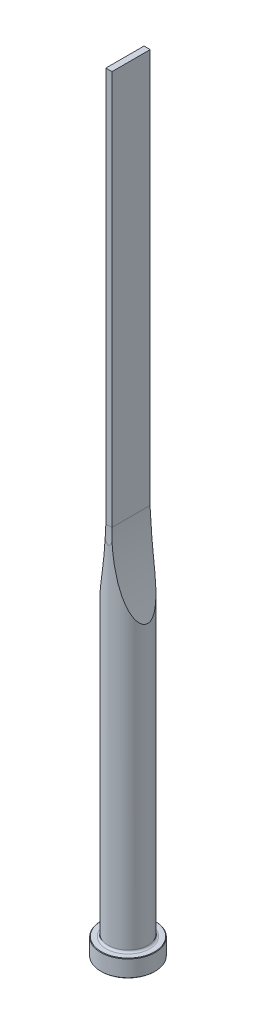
ISO-10303-21;
HEADER;
FILE_DESCRIPTION(('STEP AP214'),'2;1');
FILE_NAME('part.step','',(''),(''),'','','');
FILE_SCHEMA(('AUTOMOTIVE_DESIGN { 1 0 10303 214 1 1 1 1 }'));
ENDSEC;
DATA;
#1=APPLICATION_CONTEXT('core data for automotive mechanical design processes');
#2=APPLICATION_PROTOCOL_DEFINITION('international standard','automotive_design',2000,#1);
#3=PRODUCT_CONTEXT('',#1,'mechanical');
#4=PRODUCT('Part','Part','',(#3));
#5=PRODUCT_RELATED_PRODUCT_CATEGORY('part','',(#4));
#6=PRODUCT_DEFINITION_FORMATION('','',#4);
#7=PRODUCT_DEFINITION_CONTEXT('part definition',#1,'design');
#8=PRODUCT_DEFINITION('design','',#6,#7);
#9=PRODUCT_DEFINITION_SHAPE('','',#8);
#10=(LENGTH_UNIT() NAMED_UNIT(*) SI_UNIT(.MILLI.,.METRE.));
#11=(NAMED_UNIT(*) PLANE_ANGLE_UNIT() SI_UNIT($,.RADIAN.));
#12=(NAMED_UNIT(*) SI_UNIT($,.STERADIAN.) SOLID_ANGLE_UNIT());
#13=UNCERTAINTY_MEASURE_WITH_UNIT(LENGTH_MEASURE(1.E-05),#10,'distance_accuracy_value','');
#14=(GEOMETRIC_REPRESENTATION_CONTEXT(3) GLOBAL_UNCERTAINTY_ASSIGNED_CONTEXT((#13)) GLOBAL_UNIT_ASSIGNED_CONTEXT((#10,
#11,#12)) REPRESENTATION_CONTEXT('',''));
#15=CARTESIAN_POINT('',(0.,0.,0.));
#16=DIRECTION('',(0.,0.,1.));
#17=DIRECTION('',(1.,0.,0.));
#18=AXIS2_PLACEMENT_3D('',#15,#16,#17);
#19=CARTESIAN_POINT('',(0.,0.,0.));
#20=DIRECTION('',(0.,1.,0.));
#21=DIRECTION('',(-1.,0.,0.));
#22=AXIS2_PLACEMENT_3D('',#19,#20,#21);
#23=PLANE('',#22);
#24=CARTESIAN_POINT('',(0.,0.,0.));
#25=DIRECTION('',(0.,1.,0.));
#26=DIRECTION('',(-1.,0.,0.));
#27=AXIS2_PLACEMENT_3D('',#24,#25,#26);
#28=CIRCLE('',#27,10.8);
#29=CARTESIAN_POINT('',(-10.8,0.,0.));
#30=VERTEX_POINT('',#29);
#31=EDGE_CURVE('E133',#30,#30,#28,.T.);
#32=ORIENTED_EDGE('',*,*,#31,.F.);
#33=EDGE_LOOP('',(#32));
#34=FACE_BOUND('',#33,.T.);
#35=ADVANCED_FACE('F32',(#34),#23,.F.);
#36=CARTESIAN_POINT('',(0.,0.,0.));
#37=DIRECTION('',(0.,1.,0.));
#38=DIRECTION('',(-1.,0.,0.));
#39=AXIS2_PLACEMENT_3D('',#36,#37,#38);
#40=CONICAL_SURFACE('',#39,10.8,0.785398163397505);
#41=CARTESIAN_POINT('',(0.,0.199999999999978,0.));
#42=DIRECTION('',(0.,1.,0.));
#43=DIRECTION('',(-1.,0.,0.));
#44=AXIS2_PLACEMENT_3D('',#41,#42,#43);
#45=CIRCLE('',#44,11.);
#46=CARTESIAN_POINT('',(-11.,0.199999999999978,0.));
#47=VERTEX_POINT('',#46);
#48=EDGE_CURVE('E130',#47,#47,#45,.T.);
#49=ORIENTED_EDGE('',*,*,#48,.F.);
#50=EDGE_LOOP('',(#49));
#51=FACE_BOUND('',#50,.T.);
#52=ORIENTED_EDGE('',*,*,#31,.T.);
#53=EDGE_LOOP('',(#52));
#54=FACE_BOUND('',#53,.T.);
#55=ADVANCED_FACE('F171',(#51,#54),#40,.T.);
#56=CARTESIAN_POINT('',(0.,315.,0.));
#57=DIRECTION('',(0.,1.,0.));
#58=DIRECTION('',(-1.,0.,0.));
#59=AXIS2_PLACEMENT_3D('',#56,#57,#58);
#60=CYLINDRICAL_SURFACE('',#59,11.);
#61=CARTESIAN_POINT('',(0.,6.79999999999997,0.));
#62=DIRECTION('',(0.,1.,0.));
#63=DIRECTION('',(-1.,0.,0.));
#64=AXIS2_PLACEMENT_3D('',#61,#62,#63);
#65=CIRCLE('',#64,11.);
#66=CARTESIAN_POINT('',(-11.,6.79999999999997,0.));
#67=VERTEX_POINT('',#66);
#68=EDGE_CURVE('E127',#67,#67,#65,.T.);
#69=ORIENTED_EDGE('',*,*,#68,.F.);
#70=EDGE_LOOP('',(#69));
#71=FACE_BOUND('',#70,.T.);
#72=ORIENTED_EDGE('',*,*,#48,.T.);
#73=EDGE_LOOP('',(#72));
#74=FACE_BOUND('',#73,.T.);
#75=ADVANCED_FACE('F176',(#71,#74),#60,.T.);
#76=CARTESIAN_POINT('',(0.,6.79999999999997,0.));
#77=DIRECTION('',(0.,-1.,0.));
#78=DIRECTION('',(1.,0.,0.));
#79=AXIS2_PLACEMENT_3D('',#76,#77,#78);
#80=CONICAL_SURFACE('',#79,11.,0.78539816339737);
#81=CARTESIAN_POINT('',(0.,7.00000000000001,0.));
#82=DIRECTION('',(0.,1.,0.));
#83=DIRECTION('',(-1.,0.,0.));
#84=AXIS2_PLACEMENT_3D('',#81,#82,#83);
#85=CIRCLE('',#84,10.8);
#86=CARTESIAN_POINT('',(-10.8,7.00000000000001,0.));
#87=VERTEX_POINT('',#86);
#88=EDGE_CURVE('E124',#87,#87,#85,.T.);
#89=ORIENTED_EDGE('',*,*,#88,.F.);
#90=EDGE_LOOP('',(#89));
#91=FACE_BOUND('',#90,.T.);
#92=ORIENTED_EDGE('',*,*,#68,.T.);
#93=EDGE_LOOP('',(#92));
#94=FACE_BOUND('',#93,.T.);
#95=ADVANCED_FACE('F183',(#91,#94),#80,.T.);
#96=CARTESIAN_POINT('',(10.8,7.,0.));
#97=DIRECTION('',(0.,-1.,0.));
#98=DIRECTION('',(1.,0.,0.));
#99=AXIS2_PLACEMENT_3D('',#96,#97,#98);
#100=PLANE('',#99);
#101=CARTESIAN_POINT('',(0.,7.00000000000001,0.));
#102=DIRECTION('',(0.,1.,0.));
#103=DIRECTION('',(-1.,0.,0.));
#104=AXIS2_PLACEMENT_3D('',#101,#102,#103);
#105=CIRCLE('',#104,8.80000000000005);
#106=CARTESIAN_POINT('',(-8.80000000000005,7.00000000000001,0.));
#107=VERTEX_POINT('',#106);
#108=EDGE_CURVE('E121',#107,#107,#105,.T.);
#109=ORIENTED_EDGE('',*,*,#108,.F.);
#110=EDGE_LOOP('',(#109));
#111=FACE_BOUND('',#110,.T.);
#112=ORIENTED_EDGE('',*,*,#88,.T.);
#113=EDGE_LOOP('',(#112));
#114=FACE_BOUND('',#113,.T.);
#115=ADVANCED_FACE('F190',(#111,#114),#100,.F.);
#116=CARTESIAN_POINT('',(0.,7.8,0.));
#117=DIRECTION('',(0.,1.,0.));
#118=DIRECTION('',(-1.,0.,0.));
#119=AXIS2_PLACEMENT_3D('',#116,#117,#118);
#120=TOROIDAL_SURFACE('',#119,8.80000000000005,0.8);
#121=CARTESIAN_POINT('',(0.,7.79999999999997,0.));
#122=DIRECTION('',(0.,1.,0.));
#123=DIRECTION('',(-1.,0.,0.));
#124=AXIS2_PLACEMENT_3D('',#121,#122,#123);
#125=CIRCLE('',#124,8.00000000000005);
#126=CARTESIAN_POINT('',(-8.00000000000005,7.79999999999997,0.));
#127=VERTEX_POINT('',#126);
#128=EDGE_CURVE('E112',#127,#127,#125,.T.);
#129=ORIENTED_EDGE('',*,*,#128,.F.);
#130=EDGE_LOOP('',(#129));
#131=FACE_BOUND('',#130,.T.);
#132=ORIENTED_EDGE('',*,*,#108,.T.);
#133=EDGE_LOOP('',(#132));
#134=FACE_BOUND('',#133,.T.);
#135=ADVANCED_FACE('F168',(#131,#134),#120,.F.);
#136=CARTESIAN_POINT('',(0.,315.,0.));
#137=DIRECTION('',(0.,1.,0.));
#138=DIRECTION('',(-1.,0.,0.));
#139=AXIS2_PLACEMENT_3D('',#136,#137,#138);
#140=CYLINDRICAL_SURFACE('',#139,8.00000000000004);
#141=CARTESIAN_POINT('',(8.00000000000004,120.802960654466,0.));
#142=CARTESIAN_POINT('',(8.00000026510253,120.802960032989,0.0938122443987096));
#143=CARTESIAN_POINT('',(7.99834450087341,120.80698987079,0.187620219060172));
#144=CARTESIAN_POINT('',(7.99177963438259,120.822978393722,0.374456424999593));
#145=CARTESIAN_POINT('',(7.98686934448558,120.834939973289,0.467484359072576));
#146=CARTESIAN_POINT('',(7.96742702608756,120.882346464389,0.744490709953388));
#147=CARTESIAN_POINT('',(7.94818381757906,120.929312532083,0.926267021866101));
#148=CARTESIAN_POINT('',(7.89369415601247,121.062816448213,1.31794712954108));
#149=CARTESIAN_POINT('',(7.85585748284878,121.155789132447,1.52523495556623));
#150=CARTESIAN_POINT('',(7.76860681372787,121.371582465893,1.92093916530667));
#151=CARTESIAN_POINT('',(7.71917225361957,121.494456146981,2.10932117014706));
#152=CARTESIAN_POINT('',(7.62330404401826,121.734568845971,2.43048963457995));
#153=CARTESIAN_POINT('',(7.57832229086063,121.847826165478,2.56676942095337));
#154=CARTESIAN_POINT('',(7.48466719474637,122.085181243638,2.82826049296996));
#155=CARTESIAN_POINT('',(7.43599151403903,122.209285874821,2.95346465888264));
#156=CARTESIAN_POINT('',(7.33595072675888,122.466150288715,3.19386992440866));
#157=CARTESIAN_POINT('',(7.2845813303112,122.598923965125,3.30905424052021));
#158=CARTESIAN_POINT('',(7.17999527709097,122.871265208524,3.53024569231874));
#159=CARTESIAN_POINT('',(7.12677789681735,123.010835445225,3.63624917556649));
#160=CARTESIAN_POINT('',(7.01894146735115,123.295866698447,3.84028904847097));
#161=CARTESIAN_POINT('',(6.96431849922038,123.441345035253,3.938299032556));
#162=CARTESIAN_POINT('',(6.85428087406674,123.736803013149,4.12683031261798));
#163=CARTESIAN_POINT('',(6.7988660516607,123.886783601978,4.21735001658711));
#164=CARTESIAN_POINT('',(6.63190545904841,124.342495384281,4.47892704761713));
#165=CARTESIAN_POINT('',(6.51971379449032,124.653811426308,4.63987327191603));
#166=CARTESIAN_POINT('',(6.2954138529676,125.287516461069,4.93992334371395));
#167=CARTESIAN_POINT('',(6.18330624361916,125.609927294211,5.07898070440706));
#168=CARTESIAN_POINT('',(6.0163194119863,126.099317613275,5.27362914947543));
#169=CARTESIAN_POINT('',(5.96086316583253,126.263378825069,5.33617863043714));
#170=CARTESIAN_POINT('',(5.85043562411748,126.593228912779,5.45702390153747));
#171=CARTESIAN_POINT('',(5.7954643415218,126.75901783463,5.51531957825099));
#172=CARTESIAN_POINT('',(5.65519725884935,127.186244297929,5.65984603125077));
#173=CARTESIAN_POINT('',(5.57032289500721,127.448780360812,5.74324284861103));
#174=CARTESIAN_POINT('',(5.40227851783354,127.976944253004,5.90158511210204));
#175=CARTESIAN_POINT('',(5.3191086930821,128.242572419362,5.97652962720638));
#176=CARTESIAN_POINT('',(5.15466196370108,128.776521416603,6.11892936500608));
#177=CARTESIAN_POINT('',(5.07338579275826,129.044843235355,6.18638172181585));
#178=CARTESIAN_POINT('',(4.91291989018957,129.583712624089,6.31456619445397));
#179=CARTESIAN_POINT('',(4.83373027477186,129.854260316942,6.37529793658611));
#180=CARTESIAN_POINT('',(4.59921321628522,130.669743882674,6.54867925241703));
#181=CARTESIAN_POINT('',(4.44722690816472,131.217581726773,6.65227031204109));
#182=CARTESIAN_POINT('',(4.15294399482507,132.318997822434,6.83984073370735));
#183=CARTESIAN_POINT('',(4.01064567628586,132.87257503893,6.92382356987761));
#184=CARTESIAN_POINT('',(3.73548723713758,133.987119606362,7.07608447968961));
#185=CARTESIAN_POINT('',(3.60267669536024,134.548109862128,7.14428371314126));
#186=CARTESIAN_POINT('',(3.34757576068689,135.673929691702,7.26730852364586));
#187=CARTESIAN_POINT('',(3.22528566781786,136.238759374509,7.32213371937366));
#188=CARTESIAN_POINT('',(2.99154866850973,137.371056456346,7.42069405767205));
#189=CARTESIAN_POINT('',(2.88009178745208,137.938520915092,7.4644394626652));
#190=CARTESIAN_POINT('',(2.66803590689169,139.076105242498,7.54283474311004));
#191=CARTESIAN_POINT('',(2.56743717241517,139.646225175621,7.5774843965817));
#192=CARTESIAN_POINT('',(2.37380329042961,140.809107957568,7.64040492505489));
#193=CARTESIAN_POINT('',(2.28116700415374,141.401951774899,7.66840353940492));
#194=CARTESIAN_POINT('',(2.10773403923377,142.58965672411,7.71787436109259));
#195=CARTESIAN_POINT('',(2.02693779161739,143.184517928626,7.73934633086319));
#196=CARTESIAN_POINT('',(1.87723712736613,144.375979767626,7.77701336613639));
#197=CARTESIAN_POINT('',(1.80833431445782,144.972580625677,7.79320772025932));
#198=CARTESIAN_POINT('',(1.68247616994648,146.167141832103,7.82134453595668));
#199=CARTESIAN_POINT('',(1.62552089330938,146.765102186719,7.83328697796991));
#200=CARTESIAN_POINT('',(1.52353769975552,147.962706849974,7.85375958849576));
#201=CARTESIAN_POINT('',(1.47852193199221,148.562352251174,7.8622862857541));
#202=CARTESIAN_POINT('',(1.40051616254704,149.762458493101,7.87655546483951));
#203=CARTESIAN_POINT('',(1.36752619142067,150.362919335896,7.88229793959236));
#204=CARTESIAN_POINT('',(1.31358947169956,151.564358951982,7.89146568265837));
#205=CARTESIAN_POINT('',(1.29264192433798,152.165337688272,7.89489110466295));
#206=CARTESIAN_POINT('',(1.26279614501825,153.367601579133,7.8997198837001));
#207=CARTESIAN_POINT('',(1.25389790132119,153.968886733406,7.90112324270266));
#208=CARTESIAN_POINT('',(1.2481528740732,155.171883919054,7.90203283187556));
#209=CARTESIAN_POINT('',(1.25131346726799,155.773595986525,7.90153790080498));
#210=CARTESIAN_POINT('',(1.26970123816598,156.976831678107,7.8986040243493));
#211=CARTESIAN_POINT('',(1.28492842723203,157.57835530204,7.89616507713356));
#212=CARTESIAN_POINT('',(1.32744390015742,158.781000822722,7.88912905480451));
#213=CARTESIAN_POINT('',(1.35473292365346,159.382122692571,7.8845318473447));
#214=CARTESIAN_POINT('',(1.42135959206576,160.583672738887,7.8727937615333));
#215=CARTESIAN_POINT('',(1.46069720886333,161.184100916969,7.86565288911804));
#216=CARTESIAN_POINT('',(1.55135792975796,162.383420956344,7.84827481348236));
#217=CARTESIAN_POINT('',(1.60266934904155,162.982313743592,7.83804062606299));
#218=CARTESIAN_POINT('',(1.71727134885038,164.178873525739,7.81373223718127));
#219=CARTESIAN_POINT('',(1.78056188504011,164.776540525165,7.79965804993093));
#220=CARTESIAN_POINT('',(1.91907692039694,165.970286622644,7.76673757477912));
#221=CARTESIAN_POINT('',(1.99429995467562,166.56636590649,7.74789187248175));
#222=CARTESIAN_POINT('',(2.15663252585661,167.756670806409,7.70428465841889));
#223=CARTESIAN_POINT('',(2.24374167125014,168.350896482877,7.67952334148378));
#224=CARTESIAN_POINT('',(2.42976271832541,169.537048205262,7.62271037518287));
#225=CARTESIAN_POINT('',(2.52867257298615,170.128974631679,7.59065998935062));
#226=CARTESIAN_POINT('',(2.73820717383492,171.310190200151,7.51761515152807));
#227=CARTESIAN_POINT('',(2.84883162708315,171.899479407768,7.47662092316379));
#228=CARTESIAN_POINT('',(3.08176087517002,173.075430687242,7.38366415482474));
#229=CARTESIAN_POINT('',(3.20407586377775,173.662089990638,7.33169199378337));
#230=CARTESIAN_POINT('',(3.46009921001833,174.831580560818,7.21439925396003));
#231=CARTESIAN_POINT('',(3.59380724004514,175.414411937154,7.14907905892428));
#232=CARTESIAN_POINT('',(3.87131633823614,176.571205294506,7.00266751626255));
#233=CARTESIAN_POINT('',(4.01503806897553,177.145200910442,6.92169274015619));
#234=CARTESIAN_POINT('',(4.31300927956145,178.287506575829,6.74006510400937));
#235=CARTESIAN_POINT('',(4.46726059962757,178.855815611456,6.63940879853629));
#236=CARTESIAN_POINT('',(4.70582882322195,179.702069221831,6.47028575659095));
#237=CARTESIAN_POINT('',(4.7864796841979,179.982886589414,6.41094547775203));
#238=CARTESIAN_POINT('',(4.95008800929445,180.542319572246,6.28548116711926));
#239=CARTESIAN_POINT('',(5.03304534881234,180.820935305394,6.21935750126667));
#240=CARTESIAN_POINT('',(5.20107759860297,181.375497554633,6.0795338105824));
#241=CARTESIAN_POINT('',(5.28615168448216,181.65144505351,6.00583670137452));
#242=CARTESIAN_POINT('',(5.45823411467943,182.200286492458,5.84988654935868));
#243=CARTESIAN_POINT('',(5.54524223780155,182.473180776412,5.76763448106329));
#244=CARTESIAN_POINT('',(5.6780642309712,182.883061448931,5.63591979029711));
#245=CARTESIAN_POINT('',(5.72326667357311,183.021401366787,5.59003697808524));
#246=CARTESIAN_POINT('',(5.81405871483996,183.297013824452,5.49554477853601));
#247=CARTESIAN_POINT('',(5.85964830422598,183.434286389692,5.4469354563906));
#248=CARTESIAN_POINT('',(5.99693707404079,183.844381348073,5.29671475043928));
#249=CARTESIAN_POINT('',(6.089146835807,184.115451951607,5.19071986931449));
#250=CARTESIAN_POINT('',(6.27444481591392,184.651907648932,4.96514550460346));
#251=CARTESIAN_POINT('',(6.3675337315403,184.917287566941,4.84555422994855));
#252=CARTESIAN_POINT('',(6.55371367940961,185.440368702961,4.59061900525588));
#253=CARTESIAN_POINT('',(6.64680470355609,185.698072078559,4.45527953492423));
#254=CARTESIAN_POINT('',(6.80461930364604,186.128986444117,4.20854013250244));
#255=CARTESIAN_POINT('',(6.86963437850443,186.30475796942,4.10180464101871));
#256=CARTESIAN_POINT('',(6.9984930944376,186.649920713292,3.87785953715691));
#257=CARTESIAN_POINT('',(7.06233704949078,186.819313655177,3.76065278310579));
#258=CARTESIAN_POINT('',(7.18797318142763,187.149756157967,3.51455569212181));
#259=CARTESIAN_POINT('',(7.24976878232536,187.310819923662,3.38568635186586));
#260=CARTESIAN_POINT('',(7.37029409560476,187.622428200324,3.11460298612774));
#261=CARTESIAN_POINT('',(7.42902581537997,187.772979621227,2.97239787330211));
#262=CARTESIAN_POINT('',(7.54920486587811,188.078802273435,2.65370528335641));
#263=CARTESIAN_POINT('',(7.6100360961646,188.232207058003,2.47515980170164));
#264=CARTESIAN_POINT('',(7.72278712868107,188.514590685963,2.09698763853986));
#265=CARTESIAN_POINT('',(7.77471727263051,188.643597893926,1.89738586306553));
#266=CARTESIAN_POINT('',(7.85662422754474,188.846040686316,1.5177163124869));
#267=CARTESIAN_POINT('',(7.88890499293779,188.925400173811,1.34135369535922));
#268=CARTESIAN_POINT('',(7.9422571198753,189.056203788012,0.976901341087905));
#269=CARTESIAN_POINT('',(7.96334089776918,189.107678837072,0.788824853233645));
#270=CARTESIAN_POINT('',(7.99214354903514,189.177929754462,0.403868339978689));
#271=CARTESIAN_POINT('',(7.99975120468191,189.196433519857,0.206928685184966));
#272=CARTESIAN_POINT('',(8.00023647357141,189.197615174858,-0.187071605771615));
#273=CARTESIAN_POINT('',(7.99311624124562,189.180298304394,-0.384132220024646));
#274=CARTESIAN_POINT('',(7.96684480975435,189.116227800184,-0.747314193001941));
#275=CARTESIAN_POINT('',(7.94927624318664,189.073344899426,-0.914265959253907));
#276=CARTESIAN_POINT('',(7.90511506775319,188.965181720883,-1.23939979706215));
#277=CARTESIAN_POINT('',(7.87851864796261,188.899891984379,-1.39757813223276));
#278=CARTESIAN_POINT('',(7.80150655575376,188.710002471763,-1.78741131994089));
#279=CARTESIAN_POINT('',(7.74602888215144,188.572516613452,-2.01175610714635));
#280=CARTESIAN_POINT('',(7.62368478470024,188.266599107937,-2.43480475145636));
#281=CARTESIAN_POINT('',(7.55678605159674,188.098079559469,-2.63343297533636));
#282=CARTESIAN_POINT('',(7.42485305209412,187.762373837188,-2.98360814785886));
#283=CARTESIAN_POINT('',(7.36064911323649,187.597703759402,-3.13793327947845));
#284=CARTESIAN_POINT('',(7.2287331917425,187.256166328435,-3.43092689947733));
#285=CARTESIAN_POINT('',(7.16101842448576,187.079289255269,-3.56958267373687));
#286=CARTESIAN_POINT('',(7.02335239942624,186.716078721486,-3.83336433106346));
#287=CARTESIAN_POINT('',(6.95339714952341,186.529727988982,-3.958464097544));
#288=CARTESIAN_POINT('',(6.81234217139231,186.150007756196,-4.19656018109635));
#289=CARTESIAN_POINT('',(6.74124277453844,185.956640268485,-4.30955993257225));
#290=CARTESIAN_POINT('',(6.573765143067,185.496135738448,-4.56245246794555));
#291=CARTESIAN_POINT('',(6.47718857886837,185.226715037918,-4.69804436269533));
#292=CARTESIAN_POINT('',(6.28429832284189,184.680189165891,-4.95309298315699));
#293=CARTESIAN_POINT('',(6.18798476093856,184.403080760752,-5.07254279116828));
#294=CARTESIAN_POINT('',(5.99627862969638,183.842518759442,-5.29778630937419));
#295=CARTESIAN_POINT('',(5.90088780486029,183.5590556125,-5.40355758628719));
#296=CARTESIAN_POINT('',(5.71175237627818,182.987476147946,-5.60310348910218));
#297=CARTESIAN_POINT('',(5.61800754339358,182.699360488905,-5.69687979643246));
#298=CARTESIAN_POINT('',(5.43210994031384,182.117952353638,-5.87441675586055));
#299=CARTESIAN_POINT('',(5.3399667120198,181.824641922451,-5.95812831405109));
#300=CARTESIAN_POINT('',(5.15802018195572,181.234829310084,-6.11631871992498));
#301=CARTESIAN_POINT('',(5.06821693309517,180.938327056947,-6.19079735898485));
#302=CARTESIAN_POINT('',(4.891254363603,180.342916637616,-6.33153994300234));
#303=CARTESIAN_POINT('',(4.80409269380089,180.044010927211,-6.39781135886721));
#304=CARTESIAN_POINT('',(4.63249445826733,179.443918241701,-6.5231337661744));
#305=CARTESIAN_POINT('',(4.5480579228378,179.142731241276,-6.58218467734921));
#306=CARTESIAN_POINT('',(4.34204446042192,178.392794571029,-6.72076328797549));
#307=CARTESIAN_POINT('',(4.22217368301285,177.942864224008,-6.79644911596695));
#308=CARTESIAN_POINT('',(3.98900738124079,177.03943889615,-6.93586698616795));
#309=CARTESIAN_POINT('',(3.8757125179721,176.585943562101,-6.99959782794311));
#310=CARTESIAN_POINT('',(3.6558883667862,175.675851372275,-7.11688148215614));
#311=CARTESIAN_POINT('',(3.54936137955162,175.219253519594,-7.17043084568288));
#312=CARTESIAN_POINT('',(3.34326760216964,174.303540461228,-7.26880963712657));
#313=CARTESIAN_POINT('',(3.24370115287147,173.844425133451,-7.31363863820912));
#314=CARTESIAN_POINT('',(3.05148006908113,172.923248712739,-7.39590565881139));
#315=CARTESIAN_POINT('',(2.95883785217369,172.461183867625,-7.43333058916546));
#316=CARTESIAN_POINT('',(2.78074133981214,171.535192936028,-7.50177003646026));
#317=CARTESIAN_POINT('',(2.69528727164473,171.071266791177,-7.53278435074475));
#318=CARTESIAN_POINT('',(2.44984201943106,169.677263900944,-7.61763803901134));
#319=CARTESIAN_POINT('',(2.30072330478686,168.744749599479,-7.66330625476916));
#320=CARTESIAN_POINT('',(2.03152927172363,166.872701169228,-7.73901783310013));
#321=CARTESIAN_POINT('',(1.91152385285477,165.933155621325,-7.76902378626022));
#322=CARTESIAN_POINT('',(1.70120365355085,164.050431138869,-7.81777190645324));
#323=CARTESIAN_POINT('',(1.61088985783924,163.10725208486,-7.83651369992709));
#324=CARTESIAN_POINT('',(1.46015730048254,161.219327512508,-7.86599149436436));
#325=CARTESIAN_POINT('',(1.39970918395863,160.274584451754,-7.87673536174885));
#326=CARTESIAN_POINT('',(1.30864636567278,158.383624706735,-7.89237400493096));
#327=CARTESIAN_POINT('',(1.27803147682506,157.437408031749,-7.89726881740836));
#328=CARTESIAN_POINT('',(1.24538021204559,155.466676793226,-7.90249069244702));
#329=CARTESIAN_POINT('',(1.24589914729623,154.442117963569,-7.90240932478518));
#330=CARTESIAN_POINT('',(1.28191589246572,152.393606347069,-7.89664606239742));
#331=CARTESIAN_POINT('',(1.31741455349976,151.36965357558,-7.89096403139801));
#332=CARTESIAN_POINT('',(1.42339546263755,149.322628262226,-7.87253686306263));
#333=CARTESIAN_POINT('',(1.49391165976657,148.299557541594,-7.8597848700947));
#334=CARTESIAN_POINT('',(1.66984675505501,146.25659403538,-7.82430364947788));
#335=CARTESIAN_POINT('',(1.77526429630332,145.236701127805,-7.80157480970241));
#336=CARTESIAN_POINT('',(1.95904103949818,143.713544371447,-7.75667598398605));
#337=CARTESIAN_POINT('',(2.0243309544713,143.208510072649,-7.73997776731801));
#338=CARTESIAN_POINT('',(2.16344843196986,142.199784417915,-7.70225341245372));
#339=CARTESIAN_POINT('',(2.23727579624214,141.696093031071,-7.68122737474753));
#340=CARTESIAN_POINT('',(2.39344097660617,140.690176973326,-7.63400890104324));
#341=CARTESIAN_POINT('',(2.47578036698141,140.187952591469,-7.60781550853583));
#342=CARTESIAN_POINT('',(2.64890138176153,139.185319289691,-7.54928305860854));
#343=CARTESIAN_POINT('',(2.73968294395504,138.68491035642,-7.51694404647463));
#344=CARTESIAN_POINT('',(2.92946025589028,137.687004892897,-7.44503494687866));
#345=CARTESIAN_POINT('',(3.02844258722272,137.189504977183,-7.40547654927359));
#346=CARTESIAN_POINT('',(3.23464757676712,136.196950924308,-7.31776024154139));
#347=CARTESIAN_POINT('',(3.34187049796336,135.701896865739,-7.26960205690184));
#348=CARTESIAN_POINT('',(3.56436615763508,134.714896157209,-7.16313487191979));
#349=CARTESIAN_POINT('',(3.67963572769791,134.222948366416,-7.10482985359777));
#350=CARTESIAN_POINT('',(3.9180544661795,133.242571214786,-6.97618941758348));
#351=CARTESIAN_POINT('',(4.04120279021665,132.754141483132,-6.90585528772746));
#352=CARTESIAN_POINT('',(4.21329367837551,132.09489738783,-6.8008044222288));
#353=CARTESIAN_POINT('',(4.258923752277,131.922207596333,-6.77233773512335));
#354=CARTESIAN_POINT('',(4.35112638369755,131.577412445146,-6.7134709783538));
#355=CARTESIAN_POINT('',(4.39769892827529,131.40530707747,-6.68307093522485));
#356=CARTESIAN_POINT('',(4.53880698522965,130.889921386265,-6.5887818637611));
#357=CARTESIAN_POINT('',(4.63473141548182,130.547577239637,-6.52180480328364));
#358=CARTESIAN_POINT('',(4.8303214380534,129.865054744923,-6.37830273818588));
#359=CARTESIAN_POINT('',(4.92999531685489,129.524883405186,-6.30175559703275));
#360=CARTESIAN_POINT('',(5.13261190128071,128.848131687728,-6.13785597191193));
#361=CARTESIAN_POINT('',(5.23555450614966,128.511551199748,-6.05050382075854));
#362=CARTESIAN_POINT('',(5.46071992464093,127.790377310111,-5.84866445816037));
#363=CARTESIAN_POINT('',(5.58343680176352,127.406522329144,-5.73207009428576));
#364=CARTESIAN_POINT('',(5.83207198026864,126.646209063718,-5.47891377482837));
#365=CARTESIAN_POINT('',(5.95799150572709,126.26975370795,-5.34234408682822));
#366=CARTESIAN_POINT('',(6.14807410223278,125.713475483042,-5.11962998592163));
#367=CARTESIAN_POINT('',(6.21152554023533,125.529758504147,-5.04256291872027));
#368=CARTESIAN_POINT('',(6.33868335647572,125.165363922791,-4.88176358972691));
#369=CARTESIAN_POINT('',(6.40238970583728,124.984685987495,-4.7980320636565));
#370=CARTESIAN_POINT('',(6.52974372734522,124.627081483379,-4.62321652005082));
#371=CARTESIAN_POINT('',(6.59339140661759,124.45015210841,-4.53213826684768));
#372=CARTESIAN_POINT('',(6.72031795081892,124.100689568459,-4.34170775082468));
#373=CARTESIAN_POINT('',(6.78359689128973,123.928155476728,-4.24235725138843));
#374=CARTESIAN_POINT('',(6.89274570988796,123.633274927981,-4.06177950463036));
#375=CARTESIAN_POINT('',(6.9388053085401,123.509693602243,-3.98268342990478));
#376=CARTESIAN_POINT('',(7.03023814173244,123.265970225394,-3.81897184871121));
#377=CARTESIAN_POINT('',(7.07561139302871,123.145828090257,-3.73435647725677));
#378=CARTESIAN_POINT('',(7.16545377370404,122.909423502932,-3.55893242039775));
#379=CARTESIAN_POINT('',(7.20992117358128,122.793168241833,-3.46811310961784));
#380=CARTESIAN_POINT('',(7.2974837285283,122.56560658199,-3.27986458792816));
#381=CARTESIAN_POINT('',(7.34057904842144,122.454299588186,-3.18243617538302));
#382=CARTESIAN_POINT('',(7.42541230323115,122.236418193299,-2.97917893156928));
#383=CARTESIAN_POINT('',(7.46712917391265,122.129912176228,-2.87326702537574));
#384=CARTESIAN_POINT('',(7.54802591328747,121.924453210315,-2.65349674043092));
#385=CARTESIAN_POINT('',(7.58720523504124,121.825501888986,-2.53963665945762));
#386=CARTESIAN_POINT('',(7.69959293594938,121.543012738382,-2.1857091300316));
#387=CARTESIAN_POINT('',(7.76800505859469,121.372934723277,-1.93248529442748));
#388=CARTESIAN_POINT('',(7.86068239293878,121.143969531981,-1.49614758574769));
#389=CARTESIAN_POINT('',(7.89179585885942,121.067502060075,-1.32369077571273));
#390=CARTESIAN_POINT('',(7.94325969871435,120.941349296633,-0.967818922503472));
#391=CARTESIAN_POINT('',(7.96363765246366,120.891595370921,-0.784433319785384));
#392=CARTESIAN_POINT('',(7.98500749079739,120.839476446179,-0.499467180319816));
#393=CARTESIAN_POINT('',(7.99060980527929,120.825828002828,-0.400188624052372));
#394=CARTESIAN_POINT('',(7.99810642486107,120.807569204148,-0.200605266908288));
#395=CARTESIAN_POINT('',(7.99999971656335,120.802961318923,-0.100300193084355));
#396=CARTESIAN_POINT('',(8.00000000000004,120.802960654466,0.));
#397=B_SPLINE_CURVE_WITH_KNOTS('',3,(#141,#142,#143,#144,#145,#146,#147,#148,#149,#150,#151,
#152,#153,#154,#155,#156,#157,#158,#159,#160,#161,#162,#163,#164,#165,#166,#167,#168,#169,#170,
#171,#172,#173,#174,#175,#176,#177,#178,#179,#180,#181,#182,#183,#184,#185,#186,#187,#188,#189,
#190,#191,#192,#193,#194,#195,#196,#197,#198,#199,#200,#201,#202,#203,#204,#205,#206,#207,#208,
#209,#210,#211,#212,#213,#214,#215,#216,#217,#218,#219,#220,#221,#222,#223,#224,#225,#226,#227,
#228,#229,#230,#231,#232,#233,#234,#235,#236,#237,#238,#239,#240,#241,#242,#243,#244,#245,#246,
#247,#248,#249,#250,#251,#252,#253,#254,#255,#256,#257,#258,#259,#260,#261,#262,#263,#264,#265,
#266,#267,#268,#269,#270,#271,#272,#273,#274,#275,#276,#277,#278,#279,#280,#281,#282,#283,#284,
#285,#286,#287,#288,#289,#290,#291,#292,#293,#294,#295,#296,#297,#298,#299,#300,#301,#302,#303,
#304,#305,#306,#307,#308,#309,#310,#311,#312,#313,#314,#315,#316,#317,#318,#319,#320,#321,#322,
#323,#324,#325,#326,#327,#328,#329,#330,#331,#332,#333,#334,#335,#336,#337,#338,#339,#340,#341,
#342,#343,#344,#345,#346,#347,#348,#349,#350,#351,#352,#353,#354,#355,#356,#357,#358,#359,#360,
#361,#362,#363,#364,#365,#366,#367,#368,#369,#370,#371,#372,#373,#374,#375,#376,#377,#378,#379,
#380,#381,#382,#383,#384,#385,#386,#387,#388,#389,#390,#391,#392,#393,#394,#395,#396),
.UNSPECIFIED.,.T.,.F.,(4,2,2,2,2,2,2,2,2,2,2,2,2,2,2,2,2,2,2,2,2,2,2,2,2,2,2,2,2,2,2,2,2,2,2,2,
2,2,2,2,2,2,2,2,2,2,2,2,2,2,2,2,2,2,2,2,2,2,2,2,2,2,2,2,2,2,2,2,2,2,2,2,2,2,2,2,2,2,2,2,2,2,2,2,
2,2,2,2,2,2,2,2,2,2,2,2,2,2,2,2,2,2,2,2,2,2,2,2,2,2,2,2,2,2,2,2,2,2,2,2,2,2,2,2,2,2,2,4),(0.,
0.281321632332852,0.562745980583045,1.12596306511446,1.8131535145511,2.50157175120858,
3.04927977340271,3.59733735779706,4.14629595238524,4.69547194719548,5.24639421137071,
5.79743327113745,6.90021798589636,8.00531404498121,8.55765540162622,9.11001148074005,
9.97456303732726,10.8392097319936,11.7041860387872,12.5692104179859,14.3022923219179,
16.0350669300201,17.7763185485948,19.5176198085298,21.2573022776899,22.9970271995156,
24.798934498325,26.6009073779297,28.4031230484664,30.2053470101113,32.0093978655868,
33.8134533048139,35.6173890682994,37.4213230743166,39.2263607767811,41.0314001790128,
42.8365502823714,44.6416961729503,46.4450877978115,48.2484727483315,50.0516364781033,
51.8547408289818,53.6575328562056,55.4602798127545,57.2646133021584,59.0688949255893,
60.8602253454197,62.6518696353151,63.5461976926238,64.4404775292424,65.3344143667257,
66.2282494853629,66.6860206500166,67.1437808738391,68.0593969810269,68.9758132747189,
69.8919695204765,70.5387023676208,71.1852592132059,71.8306743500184,72.4756611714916,
73.2032815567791,73.9300507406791,74.5160460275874,75.1013901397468,75.6915429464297,
76.2816094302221,76.7993074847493,77.3172243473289,78.1193408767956,78.9237653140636,
79.6266625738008,80.3301261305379,81.0349217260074,81.7395167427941,82.6889693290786,
83.6388275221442,84.5902242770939,85.5414875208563,86.4972172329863,87.4529685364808,
88.4078433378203,89.3627287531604,90.7776786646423,92.1927705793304,93.6083409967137,
95.0239806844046,96.4421010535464,97.8602662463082,100.695941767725,103.538359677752,
106.380871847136,109.220584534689,112.060279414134,115.133337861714,118.20647108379,
121.282589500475,124.358588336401,125.887046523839,127.415469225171,128.944175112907,
130.47286973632,131.999110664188,133.525400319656,135.051092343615,136.576621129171,
137.119222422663,137.661816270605,138.747022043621,139.83478613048,140.922516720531,
142.180644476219,143.439260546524,144.066418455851,144.693507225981,145.320108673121,
145.946576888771,146.407814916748,146.869041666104,147.331079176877,147.793060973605,
148.260307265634,148.727653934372,149.658588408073,150.230255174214,150.80044606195,
151.101141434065,151.401918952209),.UNSPECIFIED.);
#398=CARTESIAN_POINT('',(1.38006479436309,150.163188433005,-7.88006479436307));
#399=VERTEX_POINT('',#398);
#400=CARTESIAN_POINT('',(1.38006479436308,150.163188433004,7.88006479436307));
#401=VERTEX_POINT('',#400);
#402=EDGE_CURVE('E138',#399,#401,#397,.T.);
#403=ORIENTED_EDGE('',*,*,#402,.T.);
#404=CARTESIAN_POINT('',(-1.98431348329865,155.,7.74999999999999));
#405=CARTESIAN_POINT('',(-1.98431671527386,155.310227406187,7.7500001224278));
#406=CARTESIAN_POINT('',(-1.97807758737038,155.620470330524,7.75160504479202));
#407=CARTESIAN_POINT('',(-1.95278869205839,156.240402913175,7.75801423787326));
#408=CARTESIAN_POINT('',(-1.93373880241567,156.550092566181,7.76281853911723));
#409=CARTESIAN_POINT('',(-1.88170740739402,157.168545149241,7.77559741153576));
#410=CARTESIAN_POINT('',(-1.84871351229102,157.477307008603,7.78357480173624));
#411=CARTESIAN_POINT('',(-1.76661059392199,158.092457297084,7.8026188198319));
#412=CARTESIAN_POINT('',(-1.71750945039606,158.398846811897,7.81368393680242));
#413=CARTESIAN_POINT('',(-1.59923669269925,159.00782620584,7.83876619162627));
#414=CARTESIAN_POINT('',(-1.53006503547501,159.310416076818,7.852783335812));
#415=CARTESIAN_POINT('',(-1.40509547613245,159.758317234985,7.8757498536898));
#416=CARTESIAN_POINT('',(-1.35990520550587,159.906616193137,7.88372857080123));
#417=CARTESIAN_POINT('',(-1.26052233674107,160.200044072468,7.90023035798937));
#418=CARTESIAN_POINT('',(-1.20633656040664,160.345175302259,7.90875301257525));
#419=CARTESIAN_POINT('',(-1.08563979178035,160.631320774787,7.92623499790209));
#420=CARTESIAN_POINT('',(-1.01906689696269,160.77231003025,7.93519634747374));
#421=CARTESIAN_POINT('',(-0.905913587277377,160.976517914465,7.94863066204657));
#422=CARTESIAN_POINT('',(-0.865970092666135,161.043388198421,7.95310844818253));
#423=CARTESIAN_POINT('',(-0.780477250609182,161.173411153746,7.96195394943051));
#424=CARTESIAN_POINT('',(-0.73493534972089,161.236568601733,7.96632180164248));
#425=CARTESIAN_POINT('',(-0.636093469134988,161.357858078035,7.97482874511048));
#426=CARTESIAN_POINT('',(-0.582709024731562,161.415922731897,7.97896456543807));
#427=CARTESIAN_POINT('',(-0.466606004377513,161.521734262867,7.98659018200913));
#428=CARTESIAN_POINT('',(-0.403961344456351,161.569556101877,7.99008464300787));
#429=CARTESIAN_POINT('',(-0.303890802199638,161.626684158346,7.99429035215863));
#430=CARTESIAN_POINT('',(-0.270535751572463,161.643017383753,7.9954986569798));
#431=CARTESIAN_POINT('',(-0.201689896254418,161.670421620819,7.99753116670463));
#432=CARTESIAN_POINT('',(-0.166200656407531,161.681496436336,7.9983556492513));
#433=CARTESIAN_POINT('',(-0.0934740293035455,161.697347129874,7.99953699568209));
#434=CARTESIAN_POINT('',(-0.0562242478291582,161.702068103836,7.99988978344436));
#435=CARTESIAN_POINT('',(0.0184986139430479,161.704424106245,8.00006574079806));
#436=CARTESIAN_POINT('',(0.0559716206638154,161.70206135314,7.99988907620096));
#437=CARTESIAN_POINT('',(0.126456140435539,161.691099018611,7.99907121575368));
#438=CARTESIAN_POINT('',(0.1595633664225,161.683086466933,7.99847374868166));
#439=CARTESIAN_POINT('',(0.224196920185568,161.662232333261,7.9969233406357));
#440=CARTESIAN_POINT('',(0.255722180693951,161.649387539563,7.99597016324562));
#441=CARTESIAN_POINT('',(0.334694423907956,161.611135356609,7.99314270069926));
#442=CARTESIAN_POINT('',(0.380692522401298,161.582771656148,7.99105553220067));
#443=CARTESIAN_POINT('',(0.46781726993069,161.519390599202,7.98642960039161));
#444=CARTESIAN_POINT('',(0.508928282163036,161.484352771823,7.98388944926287));
#445=CARTESIAN_POINT('',(0.621519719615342,161.376791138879,7.97616511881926));
#446=CARTESIAN_POINT('',(0.687515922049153,161.298628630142,7.97063757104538));
#447=CARTESIAN_POINT('',(0.808549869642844,161.13439222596,7.95926471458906));
#448=CARTESIAN_POINT('',(0.863553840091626,161.048295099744,7.95341849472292));
#449=CARTESIAN_POINT('',(0.995128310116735,160.820249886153,7.93828495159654));
#450=CARTESIAN_POINT('',(1.06569888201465,160.674876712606,7.92896886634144));
#451=CARTESIAN_POINT('',(1.19356521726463,160.378285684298,7.91071942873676));
#452=CARTESIAN_POINT('',(1.25082971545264,160.22705501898,7.90178701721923));
#453=CARTESIAN_POINT('',(1.35570730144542,159.920417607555,7.88447171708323));
#454=CARTESIAN_POINT('',(1.40326961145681,159.764993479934,7.87609186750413));
#455=CARTESIAN_POINT('',(1.49048759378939,159.452132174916,7.86005026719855));
#456=CARTESIAN_POINT('',(1.53015172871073,159.294697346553,7.8523877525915));
#457=CARTESIAN_POINT('',(1.62389561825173,158.887904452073,7.83367180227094));
#458=CARTESIAN_POINT('',(1.67325812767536,158.637435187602,7.82318329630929));
#459=CARTESIAN_POINT('',(1.75948004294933,158.134239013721,7.80423839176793));
#460=CARTESIAN_POINT('',(1.79633420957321,157.881511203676,7.79578284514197));
#461=CARTESIAN_POINT('',(1.85947965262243,157.374226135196,7.78096344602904));
#462=CARTESIAN_POINT('',(1.88575180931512,157.119666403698,7.77460338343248));
#463=CARTESIAN_POINT('',(1.92879038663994,156.60969708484,7.76403451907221));
#464=CARTESIAN_POINT('',(1.945555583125,156.354287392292,7.75982599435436));
#465=CARTESIAN_POINT('',(1.98269985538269,155.587295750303,7.75046498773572));
#466=CARTESIAN_POINT('',(1.98992728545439,155.074954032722,7.74857715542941));
#467=CARTESIAN_POINT('',(1.9752923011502,154.307450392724,7.7523007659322));
#468=CARTESIAN_POINT('',(1.96618074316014,154.051933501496,7.754631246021));
#469=CARTESIAN_POINT('',(1.9390669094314,153.541399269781,7.76145849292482));
#470=CARTESIAN_POINT('',(1.92106540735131,153.286381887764,7.76595507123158));
#471=CARTESIAN_POINT('',(1.87471171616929,152.768760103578,7.77727743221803));
#472=CARTESIAN_POINT('',(1.84603457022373,152.506186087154,7.78417584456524));
#473=CARTESIAN_POINT('',(1.77703413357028,151.982449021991,7.80021933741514));
#474=CARTESIAN_POINT('',(1.73670382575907,151.721286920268,7.809365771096));
#475=CARTESIAN_POINT('',(1.64221244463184,151.202440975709,7.82978141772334));
#476=CARTESIAN_POINT('',(1.58809931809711,150.944748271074,7.84104323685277));
#477=CARTESIAN_POINT('',(1.46204823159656,150.434028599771,7.86553499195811));
#478=CARTESIAN_POINT('',(1.39013277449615,150.180996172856,7.87876243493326));
#479=CARTESIAN_POINT('',(1.24596652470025,149.758208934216,7.90260735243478));
#480=CARTESIAN_POINT('',(1.18030295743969,149.586266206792,7.91281560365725));
#481=CARTESIAN_POINT('',(1.06809293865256,149.334388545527,7.92846600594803));
#482=CARTESIAN_POINT('',(1.02839107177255,149.251413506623,7.93374063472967));
#483=CARTESIAN_POINT('',(0.943234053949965,149.088500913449,7.94431637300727));
#484=CARTESIAN_POINT('',(0.89778393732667,149.008560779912,7.94961745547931));
#485=CARTESIAN_POINT('',(0.799114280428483,148.852801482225,7.96014485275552));
#486=CARTESIAN_POINT('',(0.745844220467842,148.777013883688,7.96537041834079));
#487=CARTESIAN_POINT('',(0.629294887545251,148.633608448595,7.9754260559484));
#488=CARTESIAN_POINT('',(0.566066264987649,148.565952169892,7.98025795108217));
#489=CARTESIAN_POINT('',(0.463628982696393,148.478011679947,7.98661948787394));
#490=CARTESIAN_POINT('',(0.42964184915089,148.451733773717,7.98853391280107));
#491=CARTESIAN_POINT('',(0.358459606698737,148.40378518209,7.9920448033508));
#492=CARTESIAN_POINT('',(0.321263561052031,148.382115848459,7.9936411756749));
#493=CARTESIAN_POINT('',(0.243194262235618,148.344815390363,7.99639908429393));
#494=CARTESIAN_POINT('',(0.202275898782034,148.329275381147,7.99755405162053));
#495=CARTESIAN_POINT('',(0.118169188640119,148.306672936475,7.99923672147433));
#496=CARTESIAN_POINT('',(0.0749872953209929,148.299587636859,7.99976611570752));
#497=CARTESIAN_POINT('',(-0.00588173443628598,148.295308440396,8.00008572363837));
#498=CARTESIAN_POINT('',(-0.0435052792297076,148.296885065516,7.99996781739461));
#499=CARTESIAN_POINT('',(-0.117827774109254,148.306921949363,7.99921877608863));
#500=CARTESIAN_POINT('',(-0.154525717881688,148.315389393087,7.99858710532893));
#501=CARTESIAN_POINT('',(-0.232595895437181,148.340362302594,7.99673039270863));
#502=CARTESIAN_POINT('',(-0.273575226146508,148.358065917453,7.99541712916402));
#503=CARTESIAN_POINT('',(-0.352162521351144,148.399747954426,7.99234232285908));
#504=CARTESIAN_POINT('',(-0.389763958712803,148.4237381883,7.99057993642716));
#505=CARTESIAN_POINT('',(-0.485855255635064,148.493886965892,7.98546133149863));
#506=CARTESIAN_POINT('',(-0.54134011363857,148.544087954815,7.98183154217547));
#507=CARTESIAN_POINT('',(-0.644637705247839,148.651745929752,7.97415343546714));
#508=CARTESIAN_POINT('',(-0.692427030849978,148.709224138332,7.97010390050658));
#509=CARTESIAN_POINT('',(-0.799319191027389,148.851743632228,7.96021325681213));
#510=CARTESIAN_POINT('',(-0.855638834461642,148.938840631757,7.95428552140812));
#511=CARTESIAN_POINT('',(-0.959916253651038,149.117968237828,7.94237323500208));
#512=CARTESIAN_POINT('',(-1.00785629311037,149.210008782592,7.93638859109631));
#513=CARTESIAN_POINT('',(-1.09751573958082,149.39765308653,7.92448807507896));
#514=CARTESIAN_POINT('',(-1.13920034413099,149.49327333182,7.91857274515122));
#515=CARTESIAN_POINT('',(-1.2173364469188,149.686501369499,7.90693623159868));
#516=CARTESIAN_POINT('',(-1.25379292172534,149.784107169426,7.90121486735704));
#517=CARTESIAN_POINT('',(-1.34437964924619,150.043549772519,7.88643899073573));
#518=CARTESIAN_POINT('',(-1.39494790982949,150.206639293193,7.8775865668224));
#519=CARTESIAN_POINT('',(-1.48735690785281,150.535336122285,7.86065726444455));
#520=CARTESIAN_POINT('',(-1.52919309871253,150.700944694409,7.85258079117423));
#521=CARTESIAN_POINT('',(-1.64425478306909,151.200850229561,7.82960352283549));
#522=CARTESIAN_POINT('',(-1.70685011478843,151.537656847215,7.81598758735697));
#523=CARTESIAN_POINT('',(-1.81102700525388,152.214159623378,7.79248898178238));
#524=CARTESIAN_POINT('',(-1.85262553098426,152.553853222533,7.78260329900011));
#525=CARTESIAN_POINT('',(-1.91832121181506,153.234655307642,7.76667194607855));
#526=CARTESIAN_POINT('',(-1.94243656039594,153.575761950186,7.76062228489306));
#527=CARTESIAN_POINT('',(-1.96728840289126,154.097615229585,7.75434300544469));
#528=CARTESIAN_POINT('',(-1.97368703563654,154.278102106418,7.75271412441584));
#529=CARTESIAN_POINT('',(-1.98219712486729,154.639057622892,7.75054296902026));
#530=CARTESIAN_POINT('',(-1.98431160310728,154.819526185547,7.749999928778));
#531=CARTESIAN_POINT('',(-1.98431348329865,155.,7.74999999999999));
#532=B_SPLINE_CURVE_WITH_KNOTS('',3,(#404,#405,#406,#407,#408,#409,#410,#411,#412,#413,#414,
#415,#416,#417,#418,#419,#420,#421,#422,#423,#424,#425,#426,#427,#428,#429,#430,#431,#432,#433,
#434,#435,#436,#437,#438,#439,#440,#441,#442,#443,#444,#445,#446,#447,#448,#449,#450,#451,#452,
#453,#454,#455,#456,#457,#458,#459,#460,#461,#462,#463,#464,#465,#466,#467,#468,#469,#470,#471,
#472,#473,#474,#475,#476,#477,#478,#479,#480,#481,#482,#483,#484,#485,#486,#487,#488,#489,#490,
#491,#492,#493,#494,#495,#496,#497,#498,#499,#500,#501,#502,#503,#504,#505,#506,#507,#508,#509,
#510,#511,#512,#513,#514,#515,#516,#517,#518,#519,#520,#521,#522,#523,#524,#525,#526,#527,#528,
#529,#530,#531),.UNSPECIFIED.,.T.,.F.,(4,2,2,2,2,2,2,2,2,2,2,2,2,2,2,2,2,2,2,2,2,2,2,2,2,2,2,2,
2,2,2,2,2,2,2,2,2,2,2,2,2,2,2,2,2,2,2,2,2,2,2,2,2,2,2,2,2,2,2,2,2,2,2,4),(0.,0.930639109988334,
1.86128709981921,2.79276374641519,3.72378538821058,4.65480902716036,5.12029423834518,
5.5854280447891,6.05295194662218,6.28681493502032,6.52037015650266,6.75665551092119,
6.99114758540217,7.10227588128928,7.21332366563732,7.32532499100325,7.43729124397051,
7.53907003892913,7.64091660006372,7.80221859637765,7.96402354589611,8.26964178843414,
8.57618510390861,9.06056112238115,9.54606401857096,10.034046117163,10.5215025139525,
11.2875556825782,12.0539293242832,12.8216815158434,13.5895325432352,15.1252430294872,
15.8921995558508,16.6590893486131,17.4515367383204,18.244462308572,19.03466630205,
19.8238765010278,20.3760654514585,20.6523112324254,20.9283167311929,21.2061909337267,
21.4826949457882,21.6114304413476,21.7402036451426,21.870824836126,22.0010919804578,
22.113392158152,22.2258095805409,22.3590451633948,22.4925328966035,22.716001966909,
22.9401384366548,23.2510520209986,23.5626159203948,23.8758536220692,24.1887911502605,
24.7013662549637,25.2142075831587,26.2416829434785,27.2683266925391,28.2939005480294,
28.835679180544,29.3770755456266),.UNSPECIFIED.);
#533=CARTESIAN_POINT('',(-1.38006479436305,150.163188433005,7.88006479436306));
#534=VERTEX_POINT('',#533);
#535=EDGE_CURVE('E104',#401,#534,#532,.T.);
#536=ORIENTED_EDGE('',*,*,#535,.T.);
#537=CARTESIAN_POINT('',(-8.00000000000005,120.802960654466,0.));
#538=CARTESIAN_POINT('',(-8.00000026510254,120.802960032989,-0.0938122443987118));
#539=CARTESIAN_POINT('',(-7.99834450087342,120.80698987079,-0.187620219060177));
#540=CARTESIAN_POINT('',(-7.99177963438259,120.822978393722,-0.3744564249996));
#541=CARTESIAN_POINT('',(-7.98686934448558,120.834939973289,-0.467484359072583));
#542=CARTESIAN_POINT('',(-7.96742702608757,120.882346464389,-0.744490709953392));
#543=CARTESIAN_POINT('',(-7.94818381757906,120.929312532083,-0.926267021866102));
#544=CARTESIAN_POINT('',(-7.89369415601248,121.062816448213,-1.31794712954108));
#545=CARTESIAN_POINT('',(-7.85585748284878,121.155789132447,-1.52523495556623));
#546=CARTESIAN_POINT('',(-7.76860681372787,121.371582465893,-1.92093916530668));
#547=CARTESIAN_POINT('',(-7.71917225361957,121.494456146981,-2.10932117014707));
#548=CARTESIAN_POINT('',(-7.62330404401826,121.734568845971,-2.43048963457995));
#549=CARTESIAN_POINT('',(-7.57832229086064,121.847826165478,-2.56676942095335));
#550=CARTESIAN_POINT('',(-7.48466719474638,122.085181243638,-2.82826049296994));
#551=CARTESIAN_POINT('',(-7.43599151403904,122.209285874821,-2.95346465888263));
#552=CARTESIAN_POINT('',(-7.33595072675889,122.466150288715,-3.19386992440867));
#553=CARTESIAN_POINT('',(-7.2845813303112,122.598923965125,-3.30905424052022));
#554=CARTESIAN_POINT('',(-7.17999527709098,122.871265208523,-3.53024569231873));
#555=CARTESIAN_POINT('',(-7.12677789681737,123.010835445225,-3.63624917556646));
#556=CARTESIAN_POINT('',(-7.01894146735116,123.295866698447,-3.84028904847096));
#557=CARTESIAN_POINT('',(-6.96431849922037,123.441345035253,-3.93829903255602));
#558=CARTESIAN_POINT('',(-6.85428087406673,123.736803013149,-4.12683031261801));
#559=CARTESIAN_POINT('',(-6.79886605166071,123.886783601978,-4.21735001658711));
#560=CARTESIAN_POINT('',(-6.63190545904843,124.342495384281,-4.47892704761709));
#561=CARTESIAN_POINT('',(-6.51971379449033,124.653811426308,-4.63987327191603));
#562=CARTESIAN_POINT('',(-6.2954138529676,125.287516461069,-4.93992334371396));
#563=CARTESIAN_POINT('',(-6.18330624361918,125.609927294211,-5.07898070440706));
#564=CARTESIAN_POINT('',(-6.0163194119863,126.099317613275,-5.27362914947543));
#565=CARTESIAN_POINT('',(-5.96086316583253,126.263378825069,-5.33617863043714));
#566=CARTESIAN_POINT('',(-5.85043562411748,126.593228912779,-5.45702390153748));
#567=CARTESIAN_POINT('',(-5.7954643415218,126.75901783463,-5.515319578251));
#568=CARTESIAN_POINT('',(-5.65519725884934,127.186244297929,-5.65984603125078));
#569=CARTESIAN_POINT('',(-5.57032289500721,127.448780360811,-5.74324284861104));
#570=CARTESIAN_POINT('',(-5.40227851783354,127.976944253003,-5.90158511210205));
#571=CARTESIAN_POINT('',(-5.3191086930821,128.242572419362,-5.9765296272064));
#572=CARTESIAN_POINT('',(-5.15466196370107,128.776521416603,-6.11892936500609));
#573=CARTESIAN_POINT('',(-5.07338579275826,129.044843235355,-6.18638172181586));
#574=CARTESIAN_POINT('',(-4.91291989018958,129.583712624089,-6.31456619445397));
#575=CARTESIAN_POINT('',(-4.83373027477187,129.854260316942,-6.37529793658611));
#576=CARTESIAN_POINT('',(-4.59921321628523,130.669743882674,-6.54867925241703));
#577=CARTESIAN_POINT('',(-4.44722690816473,131.217581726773,-6.65227031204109));
#578=CARTESIAN_POINT('',(-4.15294399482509,132.318997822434,-6.83984073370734));
#579=CARTESIAN_POINT('',(-4.01064567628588,132.87257503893,-6.92382356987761));
#580=CARTESIAN_POINT('',(-3.7354872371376,133.987119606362,-7.0760844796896));
#581=CARTESIAN_POINT('',(-3.60267669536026,134.548109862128,-7.14428371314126));
#582=CARTESIAN_POINT('',(-3.3475757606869,135.673929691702,-7.26730852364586));
#583=CARTESIAN_POINT('',(-3.22528566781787,136.238759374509,-7.32213371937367));
#584=CARTESIAN_POINT('',(-2.99154866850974,137.371056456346,-7.42069405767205));
#585=CARTESIAN_POINT('',(-2.8800917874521,137.938520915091,-7.46443946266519));
#586=CARTESIAN_POINT('',(-2.66803590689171,139.076105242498,-7.54283474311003));
#587=CARTESIAN_POINT('',(-2.56743717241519,139.64622517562,-7.5774843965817));
#588=CARTESIAN_POINT('',(-2.37380329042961,140.809107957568,-7.64040492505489));
#589=CARTESIAN_POINT('',(-2.28116700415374,141.401951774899,-7.66840353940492));
#590=CARTESIAN_POINT('',(-2.10773403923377,142.58965672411,-7.7178743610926));
#591=CARTESIAN_POINT('',(-2.02693779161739,143.184517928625,-7.73934633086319));
#592=CARTESIAN_POINT('',(-1.87723712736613,144.375979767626,-7.7770133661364));
#593=CARTESIAN_POINT('',(-1.80833431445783,144.972580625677,-7.79320772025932));
#594=CARTESIAN_POINT('',(-1.68247616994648,146.167141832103,-7.82134453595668));
#595=CARTESIAN_POINT('',(-1.62552089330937,146.765102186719,-7.83328697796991));
#596=CARTESIAN_POINT('',(-1.5235376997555,147.962706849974,-7.85375958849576));
#597=CARTESIAN_POINT('',(-1.47852193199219,148.562352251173,-7.86228628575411));
#598=CARTESIAN_POINT('',(-1.40051616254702,149.7624584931,-7.87655546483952));
#599=CARTESIAN_POINT('',(-1.36752619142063,150.362919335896,-7.88229793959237));
#600=CARTESIAN_POINT('',(-1.31358947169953,151.564358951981,-7.89146568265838));
#601=CARTESIAN_POINT('',(-1.29264192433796,152.165337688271,-7.89489110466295));
#602=CARTESIAN_POINT('',(-1.26279614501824,153.367601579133,-7.8997198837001));
#603=CARTESIAN_POINT('',(-1.25389790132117,153.968886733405,-7.90112324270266));
#604=CARTESIAN_POINT('',(-1.24815287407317,155.171883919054,-7.90203283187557));
#605=CARTESIAN_POINT('',(-1.25131346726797,155.773595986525,-7.90153790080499));
#606=CARTESIAN_POINT('',(-1.26970123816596,156.976831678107,-7.89860402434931));
#607=CARTESIAN_POINT('',(-1.28492842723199,157.578355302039,-7.89616507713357));
#608=CARTESIAN_POINT('',(-1.32744390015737,158.781000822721,-7.88912905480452));
#609=CARTESIAN_POINT('',(-1.35473292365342,159.382122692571,-7.8845318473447));
#610=CARTESIAN_POINT('',(-1.42135959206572,160.583672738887,-7.8727937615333));
#611=CARTESIAN_POINT('',(-1.46069720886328,161.184100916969,-7.86565288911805));
#612=CARTESIAN_POINT('',(-1.55135792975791,162.383420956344,-7.84827481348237));
#613=CARTESIAN_POINT('',(-1.6026693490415,162.982313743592,-7.83804062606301));
#614=CARTESIAN_POINT('',(-1.71727134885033,164.178873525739,-7.81373223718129));
#615=CARTESIAN_POINT('',(-1.78056188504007,164.776540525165,-7.79965804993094));
#616=CARTESIAN_POINT('',(-1.9190769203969,165.970286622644,-7.76673757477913));
#617=CARTESIAN_POINT('',(-1.99429995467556,166.56636590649,-7.74789187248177));
#618=CARTESIAN_POINT('',(-2.15663252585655,167.756670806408,-7.70428465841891));
#619=CARTESIAN_POINT('',(-2.24374167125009,168.350896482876,-7.6795233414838));
#620=CARTESIAN_POINT('',(-2.42976271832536,169.537048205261,-7.62271037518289));
#621=CARTESIAN_POINT('',(-2.52867257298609,170.128974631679,-7.59065998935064));
#622=CARTESIAN_POINT('',(-2.73820717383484,171.310190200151,-7.5176151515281));
#623=CARTESIAN_POINT('',(-2.84883162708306,171.899479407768,-7.47662092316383));
#624=CARTESIAN_POINT('',(-3.08176087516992,173.075430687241,-7.38366415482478));
#625=CARTESIAN_POINT('',(-3.20407586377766,173.662089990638,-7.33169199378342));
#626=CARTESIAN_POINT('',(-3.46009921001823,174.831580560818,-7.21439925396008));
#627=CARTESIAN_POINT('',(-3.59380724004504,175.414411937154,-7.14907905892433));
#628=CARTESIAN_POINT('',(-3.87131633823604,176.571205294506,-7.00266751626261));
#629=CARTESIAN_POINT('',(-4.01503806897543,177.145200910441,-6.92169274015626));
#630=CARTESIAN_POINT('',(-4.31300927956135,178.287506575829,-6.74006510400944));
#631=CARTESIAN_POINT('',(-4.46726059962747,178.855815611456,-6.63940879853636));
#632=CARTESIAN_POINT('',(-4.70582882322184,179.702069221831,-6.47028575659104));
#633=CARTESIAN_POINT('',(-4.7864796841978,179.982886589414,-6.41094547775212));
#634=CARTESIAN_POINT('',(-4.95008800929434,180.542319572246,-6.28548116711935));
#635=CARTESIAN_POINT('',(-5.03304534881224,180.820935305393,-6.21935750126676));
#636=CARTESIAN_POINT('',(-5.20107759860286,181.375497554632,-6.0795338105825));
#637=CARTESIAN_POINT('',(-5.28615168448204,181.65144505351,-6.00583670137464));
#638=CARTESIAN_POINT('',(-5.45823411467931,182.200286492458,-5.8498865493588));
#639=CARTESIAN_POINT('',(-5.54524223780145,182.473180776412,-5.7676344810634));
#640=CARTESIAN_POINT('',(-5.67806423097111,182.883061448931,-5.63591979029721));
#641=CARTESIAN_POINT('',(-5.72326667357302,183.021401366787,-5.59003697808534));
#642=CARTESIAN_POINT('',(-5.81405871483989,183.297013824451,-5.4955447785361));
#643=CARTESIAN_POINT('',(-5.85964830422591,183.434286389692,-5.44693545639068));
#644=CARTESIAN_POINT('',(-5.99693707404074,183.844381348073,-5.29671475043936));
#645=CARTESIAN_POINT('',(-6.08914683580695,184.115451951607,-5.19071986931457));
#646=CARTESIAN_POINT('',(-6.27444481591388,184.651907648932,-4.96514550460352));
#647=CARTESIAN_POINT('',(-6.36753373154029,184.917287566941,-4.84555422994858));
#648=CARTESIAN_POINT('',(-6.55371367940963,185.440368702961,-4.59061900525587));
#649=CARTESIAN_POINT('',(-6.64680470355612,185.698072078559,-4.4552795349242));
#650=CARTESIAN_POINT('',(-6.80461930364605,186.128986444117,-4.20854013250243));
#651=CARTESIAN_POINT('',(-6.86963437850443,186.30475796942,-4.10180464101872));
#652=CARTESIAN_POINT('',(-6.99849309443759,186.649920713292,-3.87785953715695));
#653=CARTESIAN_POINT('',(-7.06233704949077,186.819313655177,-3.76065278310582));
#654=CARTESIAN_POINT('',(-7.18797318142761,187.149756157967,-3.51455569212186));
#655=CARTESIAN_POINT('',(-7.24976878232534,187.310819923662,-3.38568635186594));
#656=CARTESIAN_POINT('',(-7.37029409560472,187.622428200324,-3.11460298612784));
#657=CARTESIAN_POINT('',(-7.42902581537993,187.772979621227,-2.97239787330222));
#658=CARTESIAN_POINT('',(-7.54920486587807,188.078802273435,-2.65370528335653));
#659=CARTESIAN_POINT('',(-7.61003609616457,188.232207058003,-2.47515980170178));
#660=CARTESIAN_POINT('',(-7.72278712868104,188.514590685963,-2.09698763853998));
#661=CARTESIAN_POINT('',(-7.7747172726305,188.643597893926,-1.89738586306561));
#662=CARTESIAN_POINT('',(-7.85662422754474,188.846040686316,-1.51771631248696));
#663=CARTESIAN_POINT('',(-7.88890499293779,188.925400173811,-1.34135369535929));
#664=CARTESIAN_POINT('',(-7.9422571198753,189.056203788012,-0.976901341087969));
#665=CARTESIAN_POINT('',(-7.96334089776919,189.107678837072,-0.788824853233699));
#666=CARTESIAN_POINT('',(-7.99214354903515,189.177929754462,-0.403868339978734));
#667=CARTESIAN_POINT('',(-7.99975120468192,189.196433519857,-0.206928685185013));
#668=CARTESIAN_POINT('',(-8.00023647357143,189.197615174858,0.187071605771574));
#669=CARTESIAN_POINT('',(-7.99311624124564,189.180298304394,0.384132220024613));
#670=CARTESIAN_POINT('',(-7.96684480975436,189.116227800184,0.747314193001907));
#671=CARTESIAN_POINT('',(-7.94927624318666,189.073344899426,0.914265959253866));
#672=CARTESIAN_POINT('',(-7.90511506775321,188.965181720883,1.23939979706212));
#673=CARTESIAN_POINT('',(-7.87851864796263,188.899891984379,1.39757813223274));
#674=CARTESIAN_POINT('',(-7.80150655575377,188.710002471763,1.78741131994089));
#675=CARTESIAN_POINT('',(-7.74602888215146,188.572516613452,2.01175610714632));
#676=CARTESIAN_POINT('',(-7.62368478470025,188.266599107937,2.43480475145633));
#677=CARTESIAN_POINT('',(-7.55678605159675,188.098079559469,2.63343297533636));
#678=CARTESIAN_POINT('',(-7.42485305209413,187.762373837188,2.98360814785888));
#679=CARTESIAN_POINT('',(-7.36064911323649,187.597703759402,3.13793327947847));
#680=CARTESIAN_POINT('',(-7.2287331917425,187.256166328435,3.43092689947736));
#681=CARTESIAN_POINT('',(-7.16101842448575,187.079289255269,3.56958267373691));
#682=CARTESIAN_POINT('',(-7.02335239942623,186.716078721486,3.8333643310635));
#683=CARTESIAN_POINT('',(-6.9533971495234,186.529727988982,3.95846409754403));
#684=CARTESIAN_POINT('',(-6.81234217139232,186.150007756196,4.19656018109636));
#685=CARTESIAN_POINT('',(-6.74124277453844,185.956640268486,4.30955993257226));
#686=CARTESIAN_POINT('',(-6.573765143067,185.496135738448,4.56245246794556));
#687=CARTESIAN_POINT('',(-6.47718857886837,185.226715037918,4.69804436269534));
#688=CARTESIAN_POINT('',(-6.28429832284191,184.680189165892,4.95309298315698));
#689=CARTESIAN_POINT('',(-6.18798476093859,184.403080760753,5.07254279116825));
#690=CARTESIAN_POINT('',(-5.9962786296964,183.842518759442,5.29778630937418));
#691=CARTESIAN_POINT('',(-5.90088780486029,183.5590556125,5.40355758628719));
#692=CARTESIAN_POINT('',(-5.71175237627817,182.987476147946,5.6031034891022));
#693=CARTESIAN_POINT('',(-5.61800754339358,182.699360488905,5.69687979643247));
#694=CARTESIAN_POINT('',(-5.43210994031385,182.117952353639,5.87441675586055));
#695=CARTESIAN_POINT('',(-5.33996671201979,181.824641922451,5.9581283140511));
#696=CARTESIAN_POINT('',(-5.15802018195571,181.234829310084,6.11631871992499));
#697=CARTESIAN_POINT('',(-5.06821693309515,180.938327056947,6.19079735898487));
#698=CARTESIAN_POINT('',(-4.89125436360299,180.342916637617,6.33153994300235));
#699=CARTESIAN_POINT('',(-4.80409269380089,180.044010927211,6.39781135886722));
#700=CARTESIAN_POINT('',(-4.63249445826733,179.443918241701,6.5231337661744));
#701=CARTESIAN_POINT('',(-4.54805792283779,179.142731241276,6.58218467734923));
#702=CARTESIAN_POINT('',(-4.34204446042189,178.392794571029,6.72076328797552));
#703=CARTESIAN_POINT('',(-4.22217368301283,177.942864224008,6.79644911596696));
#704=CARTESIAN_POINT('',(-3.98900738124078,177.03943889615,6.93586698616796));
#705=CARTESIAN_POINT('',(-3.87571251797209,176.585943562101,6.99959782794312));
#706=CARTESIAN_POINT('',(-3.65588836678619,175.675851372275,7.11688148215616));
#707=CARTESIAN_POINT('',(-3.54936137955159,175.219253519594,7.1704308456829));
#708=CARTESIAN_POINT('',(-3.34326760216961,174.303540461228,7.26880963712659));
#709=CARTESIAN_POINT('',(-3.24370115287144,173.844425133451,7.31363863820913));
#710=CARTESIAN_POINT('',(-3.0514800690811,172.923248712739,7.3959056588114));
#711=CARTESIAN_POINT('',(-2.95883785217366,172.461183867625,7.43333058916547));
#712=CARTESIAN_POINT('',(-2.7807413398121,171.535192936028,7.50177003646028));
#713=CARTESIAN_POINT('',(-2.69528727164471,171.071266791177,7.53278435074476));
#714=CARTESIAN_POINT('',(-2.44984201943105,169.677263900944,7.61763803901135));
#715=CARTESIAN_POINT('',(-2.30072330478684,168.744749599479,7.66330625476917));
#716=CARTESIAN_POINT('',(-2.03152927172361,166.872701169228,7.73901783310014));
#717=CARTESIAN_POINT('',(-1.91152385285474,165.933155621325,7.76902378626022));
#718=CARTESIAN_POINT('',(-1.70120365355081,164.050431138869,7.81777190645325));
#719=CARTESIAN_POINT('',(-1.6108898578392,163.10725208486,7.8365136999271));
#720=CARTESIAN_POINT('',(-1.4601573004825,161.219327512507,7.86599149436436));
#721=CARTESIAN_POINT('',(-1.39970918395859,160.274584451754,7.87673536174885));
#722=CARTESIAN_POINT('',(-1.30864636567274,158.383624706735,7.89237400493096));
#723=CARTESIAN_POINT('',(-1.27803147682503,157.437408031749,7.89726881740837));
#724=CARTESIAN_POINT('',(-1.24538021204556,155.466676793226,7.90249069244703));
#725=CARTESIAN_POINT('',(-1.2458991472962,154.442117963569,7.90240932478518));
#726=CARTESIAN_POINT('',(-1.28191589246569,152.393606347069,7.89664606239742));
#727=CARTESIAN_POINT('',(-1.31741455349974,151.36965357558,7.89096403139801));
#728=CARTESIAN_POINT('',(-1.42339546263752,149.322628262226,7.87253686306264));
#729=CARTESIAN_POINT('',(-1.49391165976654,148.299557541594,7.85978487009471));
#730=CARTESIAN_POINT('',(-1.66984675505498,146.25659403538,7.82430364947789));
#731=CARTESIAN_POINT('',(-1.77526429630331,145.236701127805,7.80157480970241));
#732=CARTESIAN_POINT('',(-1.95904103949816,143.713544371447,7.75667598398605));
#733=CARTESIAN_POINT('',(-2.02433095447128,143.208510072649,7.73997776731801));
#734=CARTESIAN_POINT('',(-2.16344843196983,142.199784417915,7.70225341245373));
#735=CARTESIAN_POINT('',(-2.23727579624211,141.696093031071,7.68122737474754));
#736=CARTESIAN_POINT('',(-2.39344097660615,140.690176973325,7.63400890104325));
#737=CARTESIAN_POINT('',(-2.47578036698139,140.187952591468,7.60781550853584));
#738=CARTESIAN_POINT('',(-2.64890138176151,139.185319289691,7.54928305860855));
#739=CARTESIAN_POINT('',(-2.73968294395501,138.68491035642,7.51694404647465));
#740=CARTESIAN_POINT('',(-2.92946025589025,137.687004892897,7.44503494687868));
#741=CARTESIAN_POINT('',(-3.02844258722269,137.189504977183,7.40547654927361));
#742=CARTESIAN_POINT('',(-3.2346475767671,136.196950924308,7.3177602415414));
#743=CARTESIAN_POINT('',(-3.34187049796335,135.701896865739,7.26960205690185));
#744=CARTESIAN_POINT('',(-3.56436615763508,134.714896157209,7.16313487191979));
#745=CARTESIAN_POINT('',(-3.67963572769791,134.222948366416,7.10482985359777));
#746=CARTESIAN_POINT('',(-3.9180544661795,133.242571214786,6.97618941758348));
#747=CARTESIAN_POINT('',(-4.04120279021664,132.754141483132,6.90585528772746));
#748=CARTESIAN_POINT('',(-4.2132936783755,132.09489738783,6.80080442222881));
#749=CARTESIAN_POINT('',(-4.25892375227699,131.922207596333,6.77233773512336));
#750=CARTESIAN_POINT('',(-4.35112638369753,131.577412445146,6.71347097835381));
#751=CARTESIAN_POINT('',(-4.39769892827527,131.405307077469,6.68307093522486));
#752=CARTESIAN_POINT('',(-4.53880698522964,130.889921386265,6.58878186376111));
#753=CARTESIAN_POINT('',(-4.6347314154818,130.547577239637,6.52180480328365));
#754=CARTESIAN_POINT('',(-4.83032143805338,129.865054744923,6.3783027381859));
#755=CARTESIAN_POINT('',(-4.92999531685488,129.524883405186,6.30175559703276));
#756=CARTESIAN_POINT('',(-5.1326119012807,128.848131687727,6.13785597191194));
#757=CARTESIAN_POINT('',(-5.23555450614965,128.511551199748,6.05050382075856));
#758=CARTESIAN_POINT('',(-5.46071992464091,127.790377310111,5.84866445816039));
#759=CARTESIAN_POINT('',(-5.58343680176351,127.406522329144,5.73207009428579));
#760=CARTESIAN_POINT('',(-5.83207198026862,126.646209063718,5.4789137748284));
#761=CARTESIAN_POINT('',(-5.95799150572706,126.26975370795,5.34234408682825));
#762=CARTESIAN_POINT('',(-6.14807410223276,125.713475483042,5.11962998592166));
#763=CARTESIAN_POINT('',(-6.21152554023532,125.529758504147,5.04256291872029));
#764=CARTESIAN_POINT('',(-6.33868335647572,125.165363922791,4.88176358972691));
#765=CARTESIAN_POINT('',(-6.40238970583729,124.984685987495,4.7980320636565));
#766=CARTESIAN_POINT('',(-6.52974372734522,124.627081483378,4.62321652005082));
#767=CARTESIAN_POINT('',(-6.59339140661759,124.45015210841,4.53213826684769));
#768=CARTESIAN_POINT('',(-6.72031795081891,124.100689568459,4.34170775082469));
#769=CARTESIAN_POINT('',(-6.78359689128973,123.928155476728,4.24235725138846));
#770=CARTESIAN_POINT('',(-6.89274570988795,123.633274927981,4.06177950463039));
#771=CARTESIAN_POINT('',(-6.93880530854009,123.509693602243,3.98268342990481));
#772=CARTESIAN_POINT('',(-7.03023814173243,123.265970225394,3.81897184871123));
#773=CARTESIAN_POINT('',(-7.07561139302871,123.145828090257,3.73435647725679));
#774=CARTESIAN_POINT('',(-7.16545377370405,122.909423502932,3.55893242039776));
#775=CARTESIAN_POINT('',(-7.20992117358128,122.793168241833,3.46811310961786));
#776=CARTESIAN_POINT('',(-7.2974837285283,122.56560658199,3.27986458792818));
#777=CARTESIAN_POINT('',(-7.34057904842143,122.454299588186,3.18243617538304));
#778=CARTESIAN_POINT('',(-7.42541230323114,122.236418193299,2.9791789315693));
#779=CARTESIAN_POINT('',(-7.46712917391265,122.129912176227,2.87326702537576));
#780=CARTESIAN_POINT('',(-7.54802591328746,121.924453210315,2.65349674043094));
#781=CARTESIAN_POINT('',(-7.58720523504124,121.825501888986,2.53963665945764));
#782=CARTESIAN_POINT('',(-7.69959293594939,121.543012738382,2.1857091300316));
#783=CARTESIAN_POINT('',(-7.7680050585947,121.372934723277,1.93248529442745));
#784=CARTESIAN_POINT('',(-7.8606823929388,121.143969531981,1.49614758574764));
#785=CARTESIAN_POINT('',(-7.89179585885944,121.067502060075,1.32369077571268));
#786=CARTESIAN_POINT('',(-7.94325969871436,120.941349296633,0.967818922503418));
#787=CARTESIAN_POINT('',(-7.96363765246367,120.891595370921,0.784433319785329));
#788=CARTESIAN_POINT('',(-7.9850074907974,120.839476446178,0.49946718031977));
#789=CARTESIAN_POINT('',(-7.9906098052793,120.825828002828,0.400188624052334));
#790=CARTESIAN_POINT('',(-7.99810642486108,120.807569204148,0.200605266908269));
#791=CARTESIAN_POINT('',(-7.99999971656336,120.802961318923,0.100300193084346));
#792=CARTESIAN_POINT('',(-8.00000000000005,120.802960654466,0.));
#793=B_SPLINE_CURVE_WITH_KNOTS('',3,(#537,#538,#539,#540,#541,#542,#543,#544,#545,#546,#547,
#548,#549,#550,#551,#552,#553,#554,#555,#556,#557,#558,#559,#560,#561,#562,#563,#564,#565,#566,
#567,#568,#569,#570,#571,#572,#573,#574,#575,#576,#577,#578,#579,#580,#581,#582,#583,#584,#585,
#586,#587,#588,#589,#590,#591,#592,#593,#594,#595,#596,#597,#598,#599,#600,#601,#602,#603,#604,
#605,#606,#607,#608,#609,#610,#611,#612,#613,#614,#615,#616,#617,#618,#619,#620,#621,#622,#623,
#624,#625,#626,#627,#628,#629,#630,#631,#632,#633,#634,#635,#636,#637,#638,#639,#640,#641,#642,
#643,#644,#645,#646,#647,#648,#649,#650,#651,#652,#653,#654,#655,#656,#657,#658,#659,#660,#661,
#662,#663,#664,#665,#666,#667,#668,#669,#670,#671,#672,#673,#674,#675,#676,#677,#678,#679,#680,
#681,#682,#683,#684,#685,#686,#687,#688,#689,#690,#691,#692,#693,#694,#695,#696,#697,#698,#699,
#700,#701,#702,#703,#704,#705,#706,#707,#708,#709,#710,#711,#712,#713,#714,#715,#716,#717,#718,
#719,#720,#721,#722,#723,#724,#725,#726,#727,#728,#729,#730,#731,#732,#733,#734,#735,#736,#737,
#738,#739,#740,#741,#742,#743,#744,#745,#746,#747,#748,#749,#750,#751,#752,#753,#754,#755,#756,
#757,#758,#759,#760,#761,#762,#763,#764,#765,#766,#767,#768,#769,#770,#771,#772,#773,#774,#775,
#776,#777,#778,#779,#780,#781,#782,#783,#784,#785,#786,#787,#788,#789,#790,#791,#792),
.UNSPECIFIED.,.T.,.F.,(4,2,2,2,2,2,2,2,2,2,2,2,2,2,2,2,2,2,2,2,2,2,2,2,2,2,2,2,2,2,2,2,2,2,2,2,
2,2,2,2,2,2,2,2,2,2,2,2,2,2,2,2,2,2,2,2,2,2,2,2,2,2,2,2,2,2,2,2,2,2,2,2,2,2,2,2,2,2,2,2,2,2,2,2,
2,2,2,2,2,2,2,2,2,2,2,2,2,2,2,2,2,2,2,2,2,2,2,2,2,2,2,2,2,2,2,2,2,2,2,2,2,2,2,2,2,2,2,4),(0.,
0.281321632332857,0.562745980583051,1.12596306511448,1.8131535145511,2.50157175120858,
3.04927977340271,3.59733735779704,4.14629595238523,4.69547194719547,5.24639421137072,
5.79743327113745,6.90021798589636,8.0053140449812,8.55765540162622,9.11001148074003,
9.97456303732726,10.8392097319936,11.7041860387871,12.5692104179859,14.3022923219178,
16.03506693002,17.7763185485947,19.5176198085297,21.2573022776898,22.9970271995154,
24.7989344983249,26.6009073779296,28.4031230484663,30.2053470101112,32.0093978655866,
33.8134533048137,35.6173890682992,37.4213230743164,39.2263607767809,41.0314001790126,
42.8365502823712,44.6416961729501,46.4450877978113,48.2484727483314,50.0516364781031,
51.8547408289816,53.6575328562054,55.4602798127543,57.2646133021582,59.0688949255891,
60.8602253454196,62.6518696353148,63.5461976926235,64.4404775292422,65.3344143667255,
66.2282494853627,66.6860206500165,67.1437808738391,68.059396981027,68.975813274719,
69.8919695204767,70.538702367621,71.185259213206,71.8306743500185,72.4756611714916,
73.2032815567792,73.9300507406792,74.5160460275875,75.101390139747,75.6915429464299,
76.2816094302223,76.7993074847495,77.3172243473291,78.1193408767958,78.9237653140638,
79.6266625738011,80.3301261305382,81.0349217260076,81.7395167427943,82.6889693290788,
83.6388275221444,84.590224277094,85.5414875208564,86.4972172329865,87.452968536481,
88.4078433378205,89.3627287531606,90.7776786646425,92.1927705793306,93.608340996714,
95.0239806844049,96.4421010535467,97.8602662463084,100.695941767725,103.538359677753,
106.380871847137,109.220584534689,112.060279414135,115.133337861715,118.206471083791,
121.282589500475,124.358588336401,125.887046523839,127.415469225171,128.944175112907,
130.47286973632,131.999110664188,133.525400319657,135.051092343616,136.576621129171,
137.119222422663,137.661816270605,138.747022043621,139.83478613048,140.922516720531,
142.18064447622,143.439260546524,144.066418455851,144.693507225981,145.320108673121,
145.946576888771,146.407814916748,146.869041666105,147.331079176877,147.793060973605,
148.260307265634,148.727653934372,149.658588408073,150.230255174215,150.80044606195,
151.101141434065,151.40191895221),.UNSPECIFIED.);
#794=CARTESIAN_POINT('',(-1.38006479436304,150.163188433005,-7.88006479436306));
#795=VERTEX_POINT('',#794);
#796=EDGE_CURVE('E103',#534,#795,#793,.T.);
#797=ORIENTED_EDGE('',*,*,#796,.T.);
#798=CARTESIAN_POINT('',(0.,148.296456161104,-8.00000000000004));
#799=CARTESIAN_POINT('',(0.039096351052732,148.296464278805,-7.99999935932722));
#800=CARTESIAN_POINT('',(0.0782379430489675,148.300349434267,-7.99970894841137));
#801=CARTESIAN_POINT('',(0.155115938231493,148.315366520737,-7.99858927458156));
#802=CARTESIAN_POINT('',(0.192848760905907,148.326515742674,-7.99775872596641));
#803=CARTESIAN_POINT('',(0.27467862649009,148.358151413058,-7.99541154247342));
#804=CARTESIAN_POINT('',(0.318145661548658,148.380231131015,-7.99377848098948));
#805=CARTESIAN_POINT('',(0.400997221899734,148.43095374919,-7.99005189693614));
#806=CARTESIAN_POINT('',(0.440373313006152,148.459609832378,-7.98795744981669));
#807=CARTESIAN_POINT('',(0.543373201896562,148.54456655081,-7.98179699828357));
#808=CARTESIAN_POINT('',(0.603096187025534,148.605509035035,-7.97742835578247));
#809=CARTESIAN_POINT('',(0.713580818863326,148.734919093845,-7.96830341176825));
#810=CARTESIAN_POINT('',(0.764314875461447,148.803408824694,-7.96354598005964));
#811=CARTESIAN_POINT('',(0.881557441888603,148.978624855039,-7.95159273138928));
#812=CARTESIAN_POINT('',(0.944045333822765,149.088005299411,-7.94431635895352));
#813=CARTESIAN_POINT('',(1.05872551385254,149.312120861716,-7.92984216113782));
#814=CARTESIAN_POINT('',(1.11089463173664,149.426867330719,-7.92264454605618));
#815=CARTESIAN_POINT('',(1.20766672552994,149.660178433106,-7.90847269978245));
#816=CARTESIAN_POINT('',(1.25222966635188,149.778759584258,-7.90149979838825));
#817=CARTESIAN_POINT('',(1.33508962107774,150.017938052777,-7.88792004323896));
#818=CARTESIAN_POINT('',(1.37339301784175,150.138533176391,-7.88131282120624));
#819=CARTESIAN_POINT('',(1.46786616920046,150.459010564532,-7.86441088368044));
#820=CARTESIAN_POINT('',(1.51975244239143,150.660171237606,-7.85446691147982));
#821=CARTESIAN_POINT('',(1.61304147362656,151.06499968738,-7.83583589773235));
#822=CARTESIAN_POINT('',(1.65443912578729,151.268668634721,-7.82714946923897));
#823=CARTESIAN_POINT('',(1.72864322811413,151.677989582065,-7.81109703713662));
#824=CARTESIAN_POINT('',(1.7614338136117,151.883644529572,-7.80373347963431));
#825=CARTESIAN_POINT('',(1.81952904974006,152.296063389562,-7.79039057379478));
#826=CARTESIAN_POINT('',(1.84483262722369,152.5028274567,-7.78441142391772));
#827=CARTESIAN_POINT('',(1.91082932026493,153.124779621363,-7.76858191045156));
#828=CARTESIAN_POINT('',(1.94151888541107,153.541105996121,-7.76086003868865));
#829=CARTESIAN_POINT('',(1.97966162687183,154.374337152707,-7.75121085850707));
#830=CARTESIAN_POINT('',(1.98714120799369,154.791240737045,-7.74927696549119));
#831=CARTESIAN_POINT('',(1.98011841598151,155.56826340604,-7.75107314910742));
#832=CARTESIAN_POINT('',(1.96846159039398,155.928410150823,-7.75407015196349));
#833=CARTESIAN_POINT('',(1.92746122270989,156.647595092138,-7.76436357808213));
#834=CARTESIAN_POINT('',(1.89812021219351,157.006633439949,-7.77165938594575));
#835=CARTESIAN_POINT('',(1.81953733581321,157.721252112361,-7.79044271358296));
#836=CARTESIAN_POINT('',(1.77036610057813,158.076840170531,-7.80191534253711));
#837=CARTESIAN_POINT('',(1.67790343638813,158.606653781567,-7.82212160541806));
#838=CARTESIAN_POINT('',(1.64398450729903,158.782584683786,-7.82935262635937));
#839=CARTESIAN_POINT('',(1.56878760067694,159.132814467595,-7.84476921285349));
#840=CARTESIAN_POINT('',(1.52751144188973,159.307113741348,-7.85295454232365));
#841=CARTESIAN_POINT('',(1.45249940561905,159.590743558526,-7.86709095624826));
#842=CARTESIAN_POINT('',(1.42142823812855,159.700792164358,-7.87278062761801));
#843=CARTESIAN_POINT('',(1.35496381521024,159.91960446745,-7.88449220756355));
#844=CARTESIAN_POINT('',(1.31956941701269,160.028367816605,-7.89051420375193));
#845=CARTESIAN_POINT('',(1.24359085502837,160.244091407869,-7.90284545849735));
#846=CARTESIAN_POINT('',(1.20300561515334,160.351051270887,-7.90915477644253));
#847=CARTESIAN_POINT('',(1.1154056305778,160.56226487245,-7.92198445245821));
#848=CARTESIAN_POINT('',(1.0683950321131,160.666520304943,-7.92850467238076));
#849=CARTESIAN_POINT('',(0.965781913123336,160.87134054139,-7.94165992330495));
#850=CARTESIAN_POINT('',(0.910141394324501,160.971886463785,-7.94829534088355));
#851=CARTESIAN_POINT('',(0.787418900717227,161.165705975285,-7.96139631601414));
#852=CARTESIAN_POINT('',(0.720379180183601,161.259004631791,-7.96786240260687));
#853=CARTESIAN_POINT('',(0.611085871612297,161.384022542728,-7.97669765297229));
#854=CARTESIAN_POINT('',(0.575425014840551,161.421433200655,-7.9793674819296));
#855=CARTESIAN_POINT('',(0.500040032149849,161.49205252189,-7.98444706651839));
#856=CARTESIAN_POINT('',(0.46031548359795,161.52526074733,-7.98685679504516));
#857=CARTESIAN_POINT('',(0.382315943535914,161.581179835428,-7.99094058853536));
#858=CARTESIAN_POINT('',(0.344642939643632,161.604712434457,-7.99267056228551));
#859=CARTESIAN_POINT('',(0.265969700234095,161.645399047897,-7.99567370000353));
#860=CARTESIAN_POINT('',(0.224977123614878,161.662567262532,-7.99694788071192));
#861=CARTESIAN_POINT('',(0.149638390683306,161.685703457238,-7.99866867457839));
#862=CARTESIAN_POINT('',(0.115800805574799,161.693300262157,-7.9992353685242));
#863=CARTESIAN_POINT('',(0.0473248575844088,161.702649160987,-7.99993304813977));
#864=CARTESIAN_POINT('',(0.0126871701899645,161.704406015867,-8.00006438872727));
#865=CARTESIAN_POINT('',(-0.0563682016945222,161.701883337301,-7.99987598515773));
#866=CARTESIAN_POINT('',(-0.0907858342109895,161.697602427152,-7.99955613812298));
#867=CARTESIAN_POINT('',(-0.158449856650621,161.683468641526,-7.99850254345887));
#868=CARTESIAN_POINT('',(-0.191695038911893,161.673610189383,-7.99776838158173));
#869=CARTESIAN_POINT('',(-0.268303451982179,161.644693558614,-7.99562226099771));
#870=CARTESIAN_POINT('',(-0.310880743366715,161.623583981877,-7.99406022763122));
#871=CARTESIAN_POINT('',(-0.392172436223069,161.574970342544,-7.99048594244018));
#872=CARTESIAN_POINT('',(-0.430877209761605,161.547450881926,-7.98847260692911));
#873=CARTESIAN_POINT('',(-0.532228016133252,161.465727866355,-7.98253909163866));
#874=CARTESIAN_POINT('',(-0.5911284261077,161.406961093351,-7.9783190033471));
#875=CARTESIAN_POINT('',(-0.700227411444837,161.28194436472,-7.96948335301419));
#876=CARTESIAN_POINT('',(-0.75039811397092,161.215671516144,-7.96486659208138));
#877=CARTESIAN_POINT('',(-0.865711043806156,161.047013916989,-7.95332052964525));
#878=CARTESIAN_POINT('',(-0.9270742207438,160.942080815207,-7.9463074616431));
#879=CARTESIAN_POINT('',(-1.03987784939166,160.726929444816,-7.93232910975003));
#880=CARTESIAN_POINT('',(-1.09129609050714,160.616700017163,-7.92536396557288));
#881=CARTESIAN_POINT('',(-1.18679202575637,160.392548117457,-7.91162800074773));
#882=CARTESIAN_POINT('',(-1.23083621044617,160.278611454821,-7.90485817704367));
#883=CARTESIAN_POINT('',(-1.312866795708,160.048727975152,-7.8916469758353));
#884=CARTESIAN_POINT('',(-1.35085939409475,159.932783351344,-7.88520526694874));
#885=CARTESIAN_POINT('',(-1.44469119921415,159.624732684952,-7.86869757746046));
#886=CARTESIAN_POINT('',(-1.49639904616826,159.431354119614,-7.85894929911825));
#887=CARTESIAN_POINT('',(-1.58970542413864,159.04208666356,-7.84060353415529));
#888=CARTESIAN_POINT('',(-1.63129895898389,158.846196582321,-7.83200661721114));
#889=CARTESIAN_POINT('',(-1.7062269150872,158.452418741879,-7.81602588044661));
#890=CARTESIAN_POINT('',(-1.73954539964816,158.254527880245,-7.80864441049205));
#891=CARTESIAN_POINT('',(-1.79900378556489,157.857617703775,-7.79515864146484));
#892=CARTESIAN_POINT('',(-1.82514263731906,157.658598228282,-7.7890545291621));
#893=CARTESIAN_POINT('',(-1.8943066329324,157.058071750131,-7.77264043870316));
#894=CARTESIAN_POINT('',(-1.92766801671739,156.65537598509,-7.76432170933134));
#895=CARTESIAN_POINT('',(-1.97225960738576,155.849358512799,-7.75310606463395));
#896=CARTESIAN_POINT('',(-1.98352186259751,155.446038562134,-7.75020129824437));
#897=CARTESIAN_POINT('',(-1.98512200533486,154.587861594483,-7.74979455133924));
#898=CARTESIAN_POINT('',(-1.97260584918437,154.132996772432,-7.75302944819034));
#899=CARTESIAN_POINT('',(-1.91943527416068,153.223821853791,-7.76637828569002));
#900=CARTESIAN_POINT('',(-1.87871548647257,152.769515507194,-7.7765082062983));
#901=CARTESIAN_POINT('',(-1.79254266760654,152.094359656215,-7.79663877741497));
#902=CARTESIAN_POINT('',(-1.75992520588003,151.871772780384,-7.80410794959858));
#903=CARTESIAN_POINT('',(-1.68502297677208,151.428308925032,-7.82062667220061));
#904=CARTESIAN_POINT('',(-1.64274070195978,151.207431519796,-7.82967581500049));
#905=CARTESIAN_POINT('',(-1.54656592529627,150.769053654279,-7.84923751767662));
#906=CARTESIAN_POINT('',(-1.49271352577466,150.55154424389,-7.85974497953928));
#907=CARTESIAN_POINT('',(-1.36991460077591,150.120968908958,-7.88208972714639));
#908=CARTESIAN_POINT('',(-1.30098673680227,149.907897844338,-7.89392536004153));
#909=CARTESIAN_POINT('',(-1.1843273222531,149.602647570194,-7.91193476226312));
#910=CARTESIAN_POINT('',(-1.14517898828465,149.507174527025,-7.91772404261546));
#911=CARTESIAN_POINT('',(-1.06090480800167,149.318516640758,-7.92945849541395));
#912=CARTESIAN_POINT('',(-1.01576139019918,149.225339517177,-7.93540408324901));
#913=CARTESIAN_POINT('',(-0.912381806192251,149.032598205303,-7.94799288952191));
#914=CARTESIAN_POINT('',(-0.853240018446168,148.933515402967,-7.95463843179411));
#915=CARTESIAN_POINT('',(-0.722022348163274,148.74425357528,-7.96762735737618));
#916=CARTESIAN_POINT('',(-0.650008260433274,148.65403506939,-7.97397200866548));
#917=CARTESIAN_POINT('',(-0.535224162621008,148.539878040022,-7.98214395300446));
#918=CARTESIAN_POINT('',(-0.5002460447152,148.508223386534,-7.98442909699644));
#919=CARTESIAN_POINT('',(-0.426612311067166,148.44940229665,-7.98870251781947));
#920=CARTESIAN_POINT('',(-0.387958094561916,148.422234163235,-7.99069090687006));
#921=CARTESIAN_POINT('',(-0.312865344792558,148.37786336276,-7.99395435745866));
#922=CARTESIAN_POINT('',(-0.276958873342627,148.359778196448,-7.99529161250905));
#923=CARTESIAN_POINT('',(-0.202666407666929,148.329752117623,-7.99751801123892));
#924=CARTESIAN_POINT('',(-0.164287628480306,148.317794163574,-7.99840839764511));
#925=CARTESIAN_POINT('',(-0.104582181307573,148.305257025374,-7.99934298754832));
#926=CARTESIAN_POINT('',(-0.0838083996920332,148.301970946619,-7.999588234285));
#927=CARTESIAN_POINT('',(-0.0420274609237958,148.297568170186,-7.99991692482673));
#928=CARTESIAN_POINT('',(-0.0210202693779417,148.296451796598,-8.00000034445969));
#929=CARTESIAN_POINT('',(0.,148.296456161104,-8.00000000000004));
#930=B_SPLINE_CURVE_WITH_KNOTS('',3,(#798,#799,#800,#801,#802,#803,#804,#805,#806,#807,#808,
#809,#810,#811,#812,#813,#814,#815,#816,#817,#818,#819,#820,#821,#822,#823,#824,#825,#826,#827,
#828,#829,#830,#831,#832,#833,#834,#835,#836,#837,#838,#839,#840,#841,#842,#843,#844,#845,#846,
#847,#848,#849,#850,#851,#852,#853,#854,#855,#856,#857,#858,#859,#860,#861,#862,#863,#864,#865,
#866,#867,#868,#869,#870,#871,#872,#873,#874,#875,#876,#877,#878,#879,#880,#881,#882,#883,#884,
#885,#886,#887,#888,#889,#890,#891,#892,#893,#894,#895,#896,#897,#898,#899,#900,#901,#902,#903,
#904,#905,#906,#907,#908,#909,#910,#911,#912,#913,#914,#915,#916,#917,#918,#919,#920,#921,#922,
#923,#924,#925,#926,#927,#928,#929),.UNSPECIFIED.,.T.,.F.,(4,2,2,2,2,2,2,2,2,2,2,2,2,2,2,2,2,2,
2,2,2,2,2,2,2,2,2,2,2,2,2,2,2,2,2,2,2,2,2,2,2,2,2,2,2,2,2,2,2,2,2,2,2,2,2,2,2,2,2,2,2,2,2,2,2,
4),(0.,0.117189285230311,0.234658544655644,0.38015983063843,0.525955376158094,0.780835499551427,
1.03648487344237,1.41409124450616,1.79253611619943,2.17291530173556,2.55290416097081,
3.17643764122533,3.80027407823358,4.42525243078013,5.05032032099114,6.3020419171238,
7.55233897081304,8.6329500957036,9.71340656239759,10.7900482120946,11.3278819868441,
11.8655829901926,12.2089904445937,12.5524888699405,12.8960586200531,13.2394077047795,
13.5843139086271,13.9279684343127,14.082995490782,14.2380386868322,14.3709585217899,
14.5035799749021,14.6071797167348,14.710694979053,14.8142338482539,14.9178764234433,
15.0597113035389,15.2018904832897,15.4504121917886,15.6997133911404,16.0640904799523,
16.4292721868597,16.7960707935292,17.1624912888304,17.763318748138,18.3644423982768,
18.9667149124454,19.5690754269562,20.7807360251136,21.9906381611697,23.354960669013,
24.7224559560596,25.397557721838,26.0724855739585,26.7451107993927,27.4169080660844,
27.7268212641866,28.0376637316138,28.3839125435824,28.7285417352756,28.8699770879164,
29.011358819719,29.1316134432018,29.2515317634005,29.3145295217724,29.3775366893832),.UNSPECIFIED.);
#931=EDGE_CURVE('E115',#795,#399,#930,.T.);
#932=ORIENTED_EDGE('',*,*,#931,.T.);
#933=EDGE_LOOP('',(#403,#536,#797,#932));
#934=FACE_BOUND('',#933,.T.);
#935=ORIENTED_EDGE('',*,*,#128,.T.);
#936=EDGE_LOOP('',(#935));
#937=FACE_BOUND('',#936,.T.);
#938=ADVANCED_FACE('F147',(#934,#937),#140,.T.);
#939=CARTESIAN_POINT('',(0.,315.,0.));
#940=DIRECTION('',(0.,-1.,0.));
#941=DIRECTION('',(1.,0.,0.));
#942=AXIS2_PLACEMENT_3D('',#939,#940,#941);
#943=PLANE('',#942);
#944=DIRECTION('',(0.,0.,1.));
#945=VECTOR('',#944,1.);
#946=CARTESIAN_POINT('',(-1.25000000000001,315.,0.));
#947=LINE('',#946,#945);
#948=CARTESIAN_POINT('',(-1.25,315.,-7.74999999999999));
#949=VERTEX_POINT('',#948);
#950=CARTESIAN_POINT('',(-1.25000000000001,315.,7.74999999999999));
#951=VERTEX_POINT('',#950);
#952=EDGE_CURVE('E145',#949,#951,#947,.T.);
#953=ORIENTED_EDGE('',*,*,#952,.T.);
#954=DIRECTION('',(1.,0.,0.));
#955=VECTOR('',#954,1.);
#956=CARTESIAN_POINT('',(-10.,315.,7.75));
#957=LINE('',#956,#955);
#958=CARTESIAN_POINT('',(1.25,315.,7.75));
#959=VERTEX_POINT('',#958);
#960=EDGE_CURVE('E46',#951,#959,#957,.T.);
#961=ORIENTED_EDGE('',*,*,#960,.T.);
#962=DIRECTION('',(0.,0.,-1.));
#963=VECTOR('',#962,1.);
#964=CARTESIAN_POINT('',(1.24999999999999,315.,0.));
#965=LINE('',#964,#963);
#966=CARTESIAN_POINT('',(1.25,315.,-7.74999999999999));
#967=VERTEX_POINT('',#966);
#968=EDGE_CURVE('E136',#959,#967,#965,.T.);
#969=ORIENTED_EDGE('',*,*,#968,.T.);
#970=DIRECTION('',(1.,0.,0.));
#971=VECTOR('',#970,1.);
#972=CARTESIAN_POINT('',(-10.,315.,-7.74999999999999));
#973=LINE('',#972,#971);
#974=EDGE_CURVE('E291',#949,#967,#973,.T.);
#975=ORIENTED_EDGE('',*,*,#974,.F.);
#976=EDGE_LOOP('',(#953,#961,#969,#975));
#977=FACE_BOUND('',#976,.T.);
#978=ADVANCED_FACE('F157',(#977),#943,.F.);
#979=CARTESIAN_POINT('',(91.25,155.,-10.));
#980=DIRECTION('',(0.,0.,1.));
#981=DIRECTION('',(1.,0.,0.));
#982=AXIS2_PLACEMENT_3D('',#979,#980,#981);
#983=CYLINDRICAL_SURFACE('',#982,90.);
#984=DIRECTION('',(0.,0.,1.));
#985=VECTOR('',#984,1.);
#986=CARTESIAN_POINT('',(1.25000000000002,155.,-10.));
#987=LINE('',#986,#985);
#988=CARTESIAN_POINT('',(1.25,155.,-7.75000000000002));
#989=VERTEX_POINT('',#988);
#990=CARTESIAN_POINT('',(1.25000000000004,155.,7.74999999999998));
#991=VERTEX_POINT('',#990);
#992=EDGE_CURVE('E108',#989,#991,#987,.T.);
#993=ORIENTED_EDGE('',*,*,#992,.T.);
#994=CARTESIAN_POINT('',(91.25,155.,97.75));
#995=DIRECTION('',(-0.707106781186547,0.,0.707106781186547));
#996=DIRECTION('',(0.707106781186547,0.,0.707106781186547));
#997=AXIS2_PLACEMENT_3D('',#994,#995,#996);
#998=ELLIPSE('',#997,127.279220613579,90.);
#999=EDGE_CURVE('E96',#991,#401,#998,.T.);
#1000=ORIENTED_EDGE('',*,*,#999,.T.);
#1001=ORIENTED_EDGE('',*,*,#402,.F.);
#1002=CARTESIAN_POINT('',(91.25,155.,-97.75));
#1003=DIRECTION('',(0.707106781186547,0.,0.707106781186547));
#1004=DIRECTION('',(-0.707106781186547,0.,0.707106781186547));
#1005=AXIS2_PLACEMENT_3D('',#1002,#1003,#1004);
#1006=ELLIPSE('',#1005,127.279220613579,90.);
#1007=EDGE_CURVE('E109',#399,#989,#1006,.F.);
#1008=ORIENTED_EDGE('',*,*,#1007,.T.);
#1009=EDGE_LOOP('',(#993,#1000,#1001,#1008));
#1010=FACE_BOUND('',#1009,.T.);
#1011=ADVANCED_FACE('F151',(#1010),#983,.F.);
#1012=CARTESIAN_POINT('',(1.24999999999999,315.,-10.));
#1013=DIRECTION('',(-1.,0.,0.));
#1014=DIRECTION('',(0.,-1.,0.));
#1015=AXIS2_PLACEMENT_3D('',#1012,#1013,#1014);
#1016=PLANE('',#1015);
#1017=ORIENTED_EDGE('',*,*,#968,.F.);
#1018=DIRECTION('',(0.,-1.,0.));
#1019=VECTOR('',#1018,1.);
#1020=CARTESIAN_POINT('',(1.24999999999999,315.,7.75));
#1021=LINE('',#1020,#1019);
#1022=EDGE_CURVE('E289',#959,#991,#1021,.T.);
#1023=ORIENTED_EDGE('',*,*,#1022,.T.);
#1024=ORIENTED_EDGE('',*,*,#992,.F.);
#1025=DIRECTION('',(0.,1.,0.));
#1026=VECTOR('',#1025,1.);
#1027=CARTESIAN_POINT('',(1.24999999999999,315.,-7.74999999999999));
#1028=LINE('',#1027,#1026);
#1029=EDGE_CURVE('E293',#989,#967,#1028,.T.);
#1030=ORIENTED_EDGE('',*,*,#1029,.T.);
#1031=EDGE_LOOP('',(#1017,#1023,#1024,#1030));
#1032=FACE_BOUND('',#1031,.T.);
#1033=ADVANCED_FACE('F156',(#1032),#1016,.F.);
#1034=CARTESIAN_POINT('',(-91.25,155.,-10.));
#1035=DIRECTION('',(0.,0.,1.));
#1036=DIRECTION('',(1.,0.,0.));
#1037=AXIS2_PLACEMENT_3D('',#1034,#1035,#1036);
#1038=CYLINDRICAL_SURFACE('',#1037,90.);
#1039=ORIENTED_EDGE('',*,*,#796,.F.);
#1040=CARTESIAN_POINT('',(-91.25,155.,97.75));
#1041=DIRECTION('',(0.707106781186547,0.,0.707106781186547));
#1042=DIRECTION('',(-0.707106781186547,0.,0.707106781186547));
#1043=AXIS2_PLACEMENT_3D('',#1040,#1041,#1042);
#1044=ELLIPSE('',#1043,127.279220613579,90.);
#1045=CARTESIAN_POINT('',(-1.25,155.,7.74999999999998));
#1046=VERTEX_POINT('',#1045);
#1047=EDGE_CURVE('E93',#534,#1046,#1044,.T.);
#1048=ORIENTED_EDGE('',*,*,#1047,.T.);
#1049=DIRECTION('',(0.,0.,1.));
#1050=VECTOR('',#1049,1.);
#1051=CARTESIAN_POINT('',(-1.24999999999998,155.,-10.));
#1052=LINE('',#1051,#1050);
#1053=CARTESIAN_POINT('',(-1.24999999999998,155.,-7.75000000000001));
#1054=VERTEX_POINT('',#1053);
#1055=EDGE_CURVE('E102',#1054,#1046,#1052,.T.);
#1056=ORIENTED_EDGE('',*,*,#1055,.F.);
#1057=CARTESIAN_POINT('',(-91.25,155.,-97.75));
#1058=DIRECTION('',(-0.707106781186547,0.,0.707106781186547));
#1059=DIRECTION('',(0.707106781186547,0.,0.707106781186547));
#1060=AXIS2_PLACEMENT_3D('',#1057,#1058,#1059);
#1061=ELLIPSE('',#1060,127.279220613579,90.);
#1062=EDGE_CURVE('E298',#1054,#795,#1061,.F.);
#1063=ORIENTED_EDGE('',*,*,#1062,.T.);
#1064=EDGE_LOOP('',(#1039,#1048,#1056,#1063));
#1065=FACE_BOUND('',#1064,.T.);
#1066=ADVANCED_FACE('F100',(#1065),#1038,.F.);
#1067=CARTESIAN_POINT('',(-1.25000000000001,315.,-10.));
#1068=DIRECTION('',(1.,0.,0.));
#1069=DIRECTION('',(0.,1.,0.));
#1070=AXIS2_PLACEMENT_3D('',#1067,#1068,#1069);
#1071=PLANE('',#1070);
#1072=ORIENTED_EDGE('',*,*,#1055,.T.);
#1073=DIRECTION('',(0.,1.,0.));
#1074=VECTOR('',#1073,1.);
#1075=CARTESIAN_POINT('',(-1.25000000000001,315.,7.75));
#1076=LINE('',#1075,#1074);
#1077=EDGE_CURVE('E11',#1046,#951,#1076,.T.);
#1078=ORIENTED_EDGE('',*,*,#1077,.T.);
#1079=ORIENTED_EDGE('',*,*,#952,.F.);
#1080=DIRECTION('',(0.,-1.,0.));
#1081=VECTOR('',#1080,1.);
#1082=CARTESIAN_POINT('',(-1.25000000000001,315.,-7.74999999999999));
#1083=LINE('',#1082,#1081);
#1084=EDGE_CURVE('E39',#949,#1054,#1083,.T.);
#1085=ORIENTED_EDGE('',*,*,#1084,.T.);
#1086=EDGE_LOOP('',(#1072,#1078,#1079,#1085));
#1087=FACE_BOUND('',#1086,.T.);
#1088=ADVANCED_FACE('F107',(#1087),#1071,.F.);
#1089=CARTESIAN_POINT('',(-10.,155.,-97.75));
#1090=DIRECTION('',(1.,0.,0.));
#1091=DIRECTION('',(0.,0.,-1.));
#1092=AXIS2_PLACEMENT_3D('',#1089,#1090,#1091);
#1093=CYLINDRICAL_SURFACE('',#1092,90.);
#1094=ORIENTED_EDGE('',*,*,#931,.F.);
#1095=ORIENTED_EDGE('',*,*,#1062,.F.);
#1096=DIRECTION('',(1.,0.,0.));
#1097=VECTOR('',#1096,1.);
#1098=CARTESIAN_POINT('',(-10.,155.,-7.75000000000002));
#1099=LINE('',#1098,#1097);
#1100=EDGE_CURVE('E53',#1054,#989,#1099,.T.);
#1101=ORIENTED_EDGE('',*,*,#1100,.T.);
#1102=ORIENTED_EDGE('',*,*,#1007,.F.);
#1103=EDGE_LOOP('',(#1094,#1095,#1101,#1102));
#1104=FACE_BOUND('',#1103,.T.);
#1105=ADVANCED_FACE('F245',(#1104),#1093,.F.);
#1106=CARTESIAN_POINT('',(-10.,315.,-7.74999999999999));
#1107=DIRECTION('',(0.,0.,1.));
#1108=DIRECTION('',(0.,-1.,0.));
#1109=AXIS2_PLACEMENT_3D('',#1106,#1107,#1108);
#1110=PLANE('',#1109);
#1111=ORIENTED_EDGE('',*,*,#1100,.F.);
#1112=ORIENTED_EDGE('',*,*,#1084,.F.);
#1113=ORIENTED_EDGE('',*,*,#974,.T.);
#1114=ORIENTED_EDGE('',*,*,#1029,.F.);
#1115=EDGE_LOOP('',(#1111,#1112,#1113,#1114));
#1116=FACE_BOUND('',#1115,.T.);
#1117=ADVANCED_FACE('F253',(#1116),#1110,.F.);
#1118=CARTESIAN_POINT('',(-10.,315.,7.75));
#1119=DIRECTION('',(0.,0.,-1.));
#1120=DIRECTION('',(0.,1.,0.));
#1121=AXIS2_PLACEMENT_3D('',#1118,#1119,#1120);
#1122=PLANE('',#1121);
#1123=ORIENTED_EDGE('',*,*,#960,.F.);
#1124=ORIENTED_EDGE('',*,*,#1077,.F.);
#1125=DIRECTION('',(1.,0.,0.));
#1126=VECTOR('',#1125,1.);
#1127=CARTESIAN_POINT('',(-10.,155.,7.74999999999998));
#1128=LINE('',#1127,#1126);
#1129=EDGE_CURVE('E83',#1046,#991,#1128,.T.);
#1130=ORIENTED_EDGE('',*,*,#1129,.T.);
#1131=ORIENTED_EDGE('',*,*,#1022,.F.);
#1132=EDGE_LOOP('',(#1123,#1124,#1130,#1131));
#1133=FACE_BOUND('',#1132,.T.);
#1134=ADVANCED_FACE('F82',(#1133),#1122,.F.);
#1135=CARTESIAN_POINT('',(-10.,155.,97.75));
#1136=DIRECTION('',(1.,0.,0.));
#1137=DIRECTION('',(0.,0.,-1.));
#1138=AXIS2_PLACEMENT_3D('',#1135,#1136,#1137);
#1139=CYLINDRICAL_SURFACE('',#1138,90.);
#1140=ORIENTED_EDGE('',*,*,#1129,.F.);
#1141=ORIENTED_EDGE('',*,*,#1047,.F.);
#1142=ORIENTED_EDGE('',*,*,#535,.F.);
#1143=ORIENTED_EDGE('',*,*,#999,.F.);
#1144=EDGE_LOOP('',(#1140,#1141,#1142,#1143));
#1145=FACE_BOUND('',#1144,.T.);
#1146=ADVANCED_FACE('F92',(#1145),#1139,.F.);
#1147=CLOSED_SHELL('',(#35,#55,#75,#95,#115,#135,#938,#978,#1011,#1033,#1066,#1088,#1105,#1117,
#1134,#1146));
#1148=MANIFOLD_SOLID_BREP('B2',#1147);
#1149=ADVANCED_BREP_SHAPE_REPRESENTATION('',(#18,#1148),#14);
#1150=SHAPE_DEFINITION_REPRESENTATION(#9,#1149);
ENDSEC;
END-ISO-10303-21;
